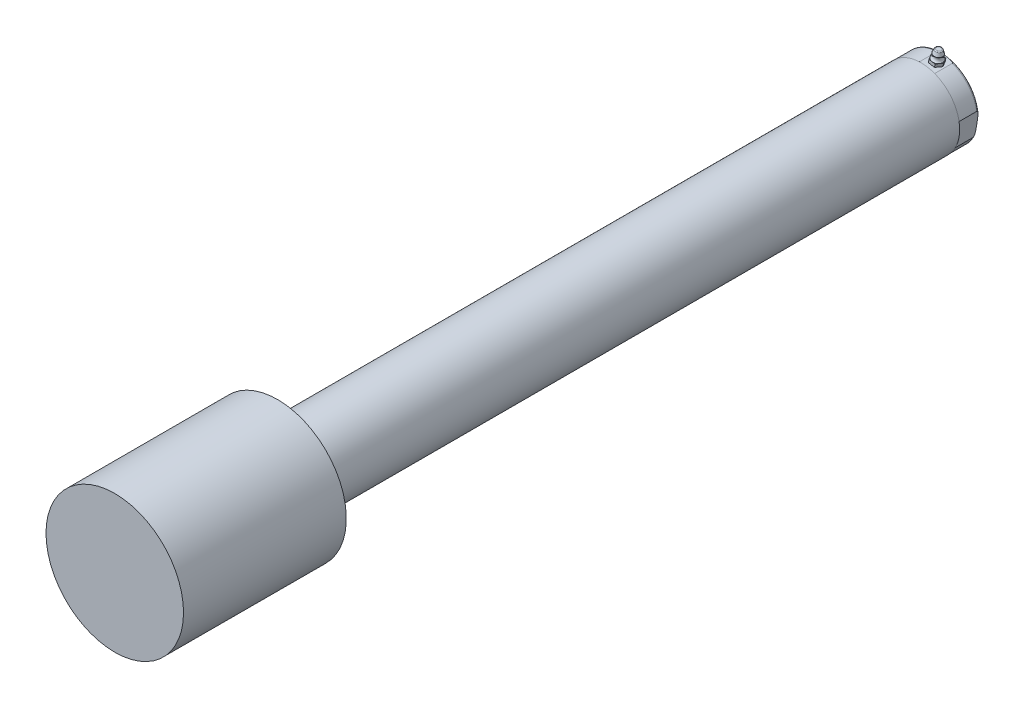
ISO-10303-21;
HEADER;
FILE_DESCRIPTION(('STEP AP214'),'2;1');
FILE_NAME('part.step','',(''),(''),'','','');
FILE_SCHEMA(('AUTOMOTIVE_DESIGN { 1 0 10303 214 1 1 1 1 }'));
ENDSEC;
DATA;
#1=APPLICATION_CONTEXT('core data for automotive mechanical design processes');
#2=APPLICATION_PROTOCOL_DEFINITION('international standard','automotive_design',2000,#1);
#3=PRODUCT_CONTEXT('',#1,'mechanical');
#4=PRODUCT('Part','Part','',(#3));
#5=PRODUCT_RELATED_PRODUCT_CATEGORY('part','',(#4));
#6=PRODUCT_DEFINITION_FORMATION('','',#4);
#7=PRODUCT_DEFINITION_CONTEXT('part definition',#1,'design');
#8=PRODUCT_DEFINITION('design','',#6,#7);
#9=PRODUCT_DEFINITION_SHAPE('','',#8);
#10=(LENGTH_UNIT() NAMED_UNIT(*) SI_UNIT(.MILLI.,.METRE.));
#11=(NAMED_UNIT(*) PLANE_ANGLE_UNIT() SI_UNIT($,.RADIAN.));
#12=(NAMED_UNIT(*) SI_UNIT($,.STERADIAN.) SOLID_ANGLE_UNIT());
#13=UNCERTAINTY_MEASURE_WITH_UNIT(LENGTH_MEASURE(1.E-05),#10,'distance_accuracy_value','');
#14=(GEOMETRIC_REPRESENTATION_CONTEXT(3) GLOBAL_UNCERTAINTY_ASSIGNED_CONTEXT((#13)) GLOBAL_UNIT_ASSIGNED_CONTEXT((#10,
#11,#12)) REPRESENTATION_CONTEXT('',''));
#15=CARTESIAN_POINT('',(0.,0.,0.));
#16=DIRECTION('',(0.,0.,1.));
#17=DIRECTION('',(1.,0.,0.));
#18=AXIS2_PLACEMENT_3D('',#15,#16,#17);
#19=CARTESIAN_POINT('',(0.,0.,-442.2648));
#20=DIRECTION('',(0.,0.,-1.));
#21=DIRECTION('',(-1.,0.,0.));
#22=AXIS2_PLACEMENT_3D('',#19,#20,#21);
#23=PLANE('',#22);
#24=CARTESIAN_POINT('',(0.,0.,-442.2648));
#25=DIRECTION('',(0.,0.,-1.));
#26=DIRECTION('',(-0.156434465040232,-0.987688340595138,0.));
#27=AXIS2_PLACEMENT_3D('',#24,#25,#26);
#28=CIRCLE('',#27,14.8844);
#29=CARTESIAN_POINT('',(-2.32843315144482,-14.7011483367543,-442.2648));
#30=VERTEX_POINT('',#29);
#31=EDGE_CURVE('E199',#30,#30,#28,.F.);
#32=ORIENTED_EDGE('',*,*,#31,.F.);
#33=EDGE_LOOP('',(#32));
#34=FACE_BOUND('',#33,.T.);
#35=ADVANCED_FACE('F17',(#34),#23,.T.);
#36=CARTESIAN_POINT('',(0.,0.,-491.0328));
#37=DIRECTION('',(0.,0.,-1.));
#38=DIRECTION('',(-1.,0.,0.));
#39=AXIS2_PLACEMENT_3D('',#36,#37,#38);
#40=PLANE('',#39);
#41=CARTESIAN_POINT('',(0.,0.,-491.0328));
#42=DIRECTION('',(0.,0.,-1.));
#43=DIRECTION('',(-1.,0.,0.));
#44=AXIS2_PLACEMENT_3D('',#41,#42,#43);
#45=CIRCLE('',#44,28.56738);
#46=CARTESIAN_POINT('',(-28.56738,0.,-491.0328));
#47=VERTEX_POINT('',#46);
#48=EDGE_CURVE('E385',#47,#47,#45,.T.);
#49=ORIENTED_EDGE('',*,*,#48,.T.);
#50=EDGE_LOOP('',(#49));
#51=FACE_BOUND('',#50,.T.);
#52=DIRECTION('',(0.987688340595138,-0.156434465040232,0.));
#53=VECTOR('',#52,1.);
#54=CARTESIAN_POINT('',(10.0230226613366,26.6373884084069,-491.0328));
#55=LINE('',#54,#53);
#56=CARTESIAN_POINT('',(-1.30105531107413,28.4309461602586,-491.0328));
#57=VERTEX_POINT('',#56);
#58=CARTESIAN_POINT('',(10.0230226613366,26.6373884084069,-491.0328));
#59=VERTEX_POINT('',#58);
#60=EDGE_CURVE('E10',#57,#59,#55,.T.);
#61=ORIENTED_EDGE('',*,*,#60,.F.);
#62=CARTESIAN_POINT('',(0.,0.,-491.0328));
#63=DIRECTION('',(0.,0.,-1.));
#64=DIRECTION('',(-1.,0.,0.));
#65=AXIS2_PLACEMENT_3D('',#62,#63,#64);
#66=CIRCLE('',#65,28.4607);
#67=CARTESIAN_POINT('',(-25.1493362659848,13.3237505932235,-491.0328));
#68=VERTEX_POINT('',#67);
#69=EDGE_CURVE('E390',#57,#68,#66,.F.);
#70=ORIENTED_EDGE('',*,*,#69,.T.);
#71=DIRECTION('',(-0.156434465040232,-0.987688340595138,0.));
#72=VECTOR('',#71,1.);
#73=CARTESIAN_POINT('',(-26.5925208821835,4.21184153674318,-491.0328));
#74=LINE('',#73,#72);
#75=CARTESIAN_POINT('',(-28.0357054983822,-4.9000675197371,-491.0328));
#76=VERTEX_POINT('',#75);
#77=EDGE_CURVE('E314',#68,#76,#74,.T.);
#78=ORIENTED_EDGE('',*,*,#77,.T.);
#79=CARTESIAN_POINT('',(0.,0.,-491.0328));
#80=DIRECTION('',(0.,0.,-1.));
#81=DIRECTION('',(-1.,0.,0.));
#82=AXIS2_PLACEMENT_3D('',#79,#80,#81);
#83=CIRCLE('',#82,28.4607);
#84=CARTESIAN_POINT('',(25.1493362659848,-13.3237505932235,-491.0328));
#85=VERTEX_POINT('',#84);
#86=EDGE_CURVE('E304',#76,#85,#83,.F.);
#87=ORIENTED_EDGE('',*,*,#86,.T.);
#88=DIRECTION('',(0.156434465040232,0.987688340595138,0.));
#89=VECTOR('',#88,1.);
#90=CARTESIAN_POINT('',(26.5925208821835,-4.21184153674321,-491.0328));
#91=LINE('',#90,#89);
#92=CARTESIAN_POINT('',(28.0357054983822,4.9000675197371,-491.0328));
#93=VERTEX_POINT('',#92);
#94=EDGE_CURVE('E315',#85,#93,#91,.T.);
#95=ORIENTED_EDGE('',*,*,#94,.T.);
#96=CARTESIAN_POINT('',(0.,0.,-491.0328));
#97=DIRECTION('',(0.,0.,-1.));
#98=DIRECTION('',(-1.,0.,0.));
#99=AXIS2_PLACEMENT_3D('',#96,#97,#98);
#100=CIRCLE('',#99,28.4607);
#101=EDGE_CURVE('E27',#93,#59,#100,.F.);
#102=ORIENTED_EDGE('',*,*,#101,.T.);
#103=EDGE_LOOP('',(#61,#70,#78,#87,#95,#102));
#104=FACE_BOUND('',#103,.T.);
#105=ADVANCED_FACE('F231',(#51,#104),#40,.T.);
#106=CARTESIAN_POINT('',(0.,0.,-465.6328));
#107=DIRECTION('',(0.,0.,-1.));
#108=DIRECTION('',(-1.,0.,0.));
#109=AXIS2_PLACEMENT_3D('',#106,#107,#108);
#110=CYLINDRICAL_SURFACE('',#109,28.56738);
#111=ORIENTED_EDGE('',*,*,#48,.F.);
#112=EDGE_LOOP('',(#111));
#113=FACE_BOUND('',#112,.T.);
#114=CARTESIAN_POINT('',(0.,0.,-15.6718));
#115=DIRECTION('',(0.,0.,-1.));
#116=DIRECTION('',(-1.,0.,0.));
#117=AXIS2_PLACEMENT_3D('',#114,#115,#116);
#118=CIRCLE('',#117,28.56738);
#119=CARTESIAN_POINT('',(-28.56738,0.,-15.6718));
#120=VERTEX_POINT('',#119);
#121=EDGE_CURVE('E373',#120,#120,#118,.T.);
#122=ORIENTED_EDGE('',*,*,#121,.T.);
#123=EDGE_LOOP('',(#122));
#124=FACE_BOUND('',#123,.T.);
#125=ADVANCED_FACE('F227',(#113,#124),#110,.T.);
#126=CARTESIAN_POINT('',(0.,0.,-15.6718));
#127=DIRECTION('',(0.,0.,-1.));
#128=DIRECTION('',(-1.,0.,0.));
#129=AXIS2_PLACEMENT_3D('',#126,#127,#128);
#130=PLANE('',#129);
#131=ORIENTED_EDGE('',*,*,#121,.F.);
#132=EDGE_LOOP('',(#131));
#133=FACE_BOUND('',#132,.T.);
#134=CARTESIAN_POINT('',(0.,0.,-15.6718));
#135=DIRECTION('',(0.,0.,-1.));
#136=DIRECTION('',(-1.,0.,0.));
#137=AXIS2_PLACEMENT_3D('',#134,#135,#136);
#138=CIRCLE('',#137,50.8);
#139=CARTESIAN_POINT('',(-50.8,0.,-15.6718));
#140=VERTEX_POINT('',#139);
#141=EDGE_CURVE('E376',#140,#140,#138,.T.);
#142=ORIENTED_EDGE('',*,*,#141,.T.);
#143=EDGE_LOOP('',(#142));
#144=FACE_BOUND('',#143,.T.);
#145=ADVANCED_FACE('F230',(#133,#144),#130,.T.);
#146=CARTESIAN_POINT('',(0.,0.,104.5718));
#147=DIRECTION('',(0.,0.,1.));
#148=DIRECTION('',(1.,0.,0.));
#149=AXIS2_PLACEMENT_3D('',#146,#147,#148);
#150=PLANE('',#149);
#151=CARTESIAN_POINT('',(0.,0.,104.5718));
#152=DIRECTION('',(0.,0.,1.));
#153=DIRECTION('',(1.,0.,0.));
#154=AXIS2_PLACEMENT_3D('',#151,#152,#153);
#155=CIRCLE('',#154,50.8);
#156=CARTESIAN_POINT('',(50.8,0.,104.5718));
#157=VERTEX_POINT('',#156);
#158=EDGE_CURVE('E380',#157,#157,#155,.T.);
#159=ORIENTED_EDGE('',*,*,#158,.T.);
#160=EDGE_LOOP('',(#159));
#161=FACE_BOUND('',#160,.T.);
#162=ADVANCED_FACE('F240',(#161),#150,.T.);
#163=CARTESIAN_POINT('',(0.,0.,104.5718));
#164=DIRECTION('',(0.,0.,-1.));
#165=DIRECTION('',(-1.,0.,0.));
#166=AXIS2_PLACEMENT_3D('',#163,#164,#165);
#167=CYLINDRICAL_SURFACE('',#166,50.8);
#168=ORIENTED_EDGE('',*,*,#158,.F.);
#169=EDGE_LOOP('',(#168));
#170=FACE_BOUND('',#169,.T.);
#171=ORIENTED_EDGE('',*,*,#141,.F.);
#172=EDGE_LOOP('',(#171));
#173=FACE_BOUND('',#172,.T.);
#174=ADVANCED_FACE('F236',(#170,#173),#167,.T.);
#175=CARTESIAN_POINT('',(5.78893702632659,36.5499099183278,-498.3988));
#176=DIRECTION('',(0.156434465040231,0.987688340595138,0.));
#177=DIRECTION('',(-0.855363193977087,0.135476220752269,0.5));
#178=AXIS2_PLACEMENT_3D('',#175,#176,#177);
#179=PLANE('',#178);
#180=CARTESIAN_POINT('',(5.78893702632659,36.5499099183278,-498.3988));
#181=DIRECTION('',(0.156434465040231,0.987688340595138,0.));
#182=DIRECTION('',(-0.855363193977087,0.135476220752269,0.5));
#183=AXIS2_PLACEMENT_3D('',#180,#181,#182);
#184=CIRCLE('',#183,1.7474960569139);
#185=CARTESIAN_POINT('',(4.29419321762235,36.786654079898,-497.525051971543));
#186=VERTEX_POINT('',#185);
#187=EDGE_CURVE('E21',#186,#186,#184,.T.);
#188=ORIENTED_EDGE('',*,*,#187,.T.);
#189=EDGE_LOOP('',(#188));
#190=FACE_BOUND('',#189,.T.);
#191=ADVANCED_FACE('F239',(#190),#179,.T.);
#192=CARTESIAN_POINT('',(5.66973396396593,35.7972914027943,-498.3988));
#193=DIRECTION('',(0.156434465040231,0.987688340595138,0.));
#194=DIRECTION('',(-0.855363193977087,0.135476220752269,0.5));
#195=AXIS2_PLACEMENT_3D('',#192,#193,#194);
#196=TOROIDAL_SURFACE('',#195,1.7474960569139,0.762);
#197=ORIENTED_EDGE('',*,*,#187,.F.);
#198=EDGE_LOOP('',(#197));
#199=FACE_BOUND('',#198,.T.);
#200=CARTESIAN_POINT('',(5.70952956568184,36.0485509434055,-498.3988));
#201=DIRECTION('',(0.156434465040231,0.987688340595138,0.));
#202=DIRECTION('',(-0.855363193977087,0.135476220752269,0.5));
#203=AXIS2_PLACEMENT_3D('',#200,#201,#202);
#204=CIRCLE('',#203,2.46577800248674);
#205=CARTESIAN_POINT('',(3.60039381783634,36.3826052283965,-497.165910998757));
#206=VERTEX_POINT('',#205);
#207=EDGE_CURVE('E182',#206,#206,#204,.F.);
#208=ORIENTED_EDGE('',*,*,#207,.F.);
#209=EDGE_LOOP('',(#208));
#210=FACE_BOUND('',#209,.T.);
#211=ADVANCED_FACE('F19',(#199,#210),#196,.T.);
#212=CARTESIAN_POINT('',(5.31212477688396,33.5394358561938,-498.3988));
#213=DIRECTION('',(-0.156434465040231,-0.987688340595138,0.));
#214=DIRECTION('',(0.855363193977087,-0.135476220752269,-0.5));
#215=AXIS2_PLACEMENT_3D('',#212,#213,#214);
#216=CONICAL_SURFACE('',#215,3.3655,0.340381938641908);
#217=ORIENTED_EDGE('',*,*,#207,.T.);
#218=EDGE_LOOP('',(#217));
#219=FACE_BOUND('',#218,.T.);
#220=CARTESIAN_POINT('',(5.31212477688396,33.5394358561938,-498.3988));
#221=DIRECTION('',(-0.156434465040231,-0.987688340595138,0.));
#222=DIRECTION('',(0.855363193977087,-0.135476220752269,-0.5));
#223=AXIS2_PLACEMENT_3D('',#220,#221,#222);
#224=CIRCLE('',#223,3.3655);
#225=CARTESIAN_POINT('',(8.19084960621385,33.083490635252,-500.08155));
#226=VERTEX_POINT('',#225);
#227=EDGE_CURVE('E152',#226,#226,#224,.T.);
#228=ORIENTED_EDGE('',*,*,#227,.F.);
#229=EDGE_LOOP('',(#228));
#230=FACE_BOUND('',#229,.T.);
#231=ADVANCED_FACE('F430',(#219,#230),#216,.T.);
#232=CARTESIAN_POINT('',(5.06209404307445,31.9608039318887,-498.3988));
#233=DIRECTION('',(-0.156434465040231,-0.987688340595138,0.));
#234=DIRECTION('',(0.855363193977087,-0.135476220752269,-0.5));
#235=AXIS2_PLACEMENT_3D('',#232,#233,#234);
#236=TOROIDAL_SURFACE('',#235,5.20693450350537,2.43833450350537);
#237=ORIENTED_EDGE('',*,*,#227,.T.);
#238=EDGE_LOOP('',(#237));
#239=FACE_BOUND('',#238,.T.);
#240=CARTESIAN_POINT('',(4.73349324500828,29.886100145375,-498.3988));
#241=DIRECTION('',(-0.156434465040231,-0.987688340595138,0.));
#242=DIRECTION('',(0.855363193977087,-0.135476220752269,-0.5));
#243=AXIS2_PLACEMENT_3D('',#240,#241,#242);
#244=CIRCLE('',#243,3.96875);
#245=CARTESIAN_POINT('',(8.12821592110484,29.3484288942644,-500.383175));
#246=VERTEX_POINT('',#245);
#247=CARTESIAN_POINT('',(8.12821592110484,29.3484288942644,-496.414425));
#248=VERTEX_POINT('',#247);
#249=EDGE_CURVE('E120',#246,#248,#244,.T.);
#250=ORIENTED_EDGE('',*,*,#249,.F.);
#251=CARTESIAN_POINT('',(4.73349324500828,29.886100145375,-502.36755));
#252=VERTEX_POINT('',#251);
#253=EDGE_CURVE('E131',#252,#246,#244,.T.);
#254=ORIENTED_EDGE('',*,*,#253,.F.);
#255=CARTESIAN_POINT('',(1.33877056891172,30.4237713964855,-500.383175));
#256=VERTEX_POINT('',#255);
#257=EDGE_CURVE('E478',#256,#252,#244,.T.);
#258=ORIENTED_EDGE('',*,*,#257,.F.);
#259=CARTESIAN_POINT('',(1.33877056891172,30.4237713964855,-496.414425));
#260=VERTEX_POINT('',#259);
#261=EDGE_CURVE('E149',#260,#256,#244,.T.);
#262=ORIENTED_EDGE('',*,*,#261,.F.);
#263=CARTESIAN_POINT('',(4.73349324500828,29.886100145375,-494.43005));
#264=VERTEX_POINT('',#263);
#265=EDGE_CURVE('E148',#264,#260,#244,.T.);
#266=ORIENTED_EDGE('',*,*,#265,.F.);
#267=EDGE_CURVE('E114',#248,#264,#244,.T.);
#268=ORIENTED_EDGE('',*,*,#267,.F.);
#269=EDGE_LOOP('',(#250,#254,#258,#262,#266,#268));
#270=FACE_BOUND('',#269,.T.);
#271=ADVANCED_FACE('F146',(#239,#270),#236,.F.);
#272=CARTESIAN_POINT('',(6.99664169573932,29.5276526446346,-502.36755));
#273=DIRECTION('',(0.156434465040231,0.987688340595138,0.));
#274=DIRECTION('',(0.493844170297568,-0.0782172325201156,0.866025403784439));
#275=AXIS2_PLACEMENT_3D('',#272,#273,#274);
#276=PLANE('',#275);
#277=ORIENTED_EDGE('',*,*,#257,.T.);
#278=DIRECTION('',(-0.987688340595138,0.156434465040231,0.));
#279=VECTOR('',#278,1.);
#280=CARTESIAN_POINT('',(6.99664169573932,29.5276526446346,-502.36755));
#281=LINE('',#280,#279);
#282=CARTESIAN_POINT('',(2.47034479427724,30.2445476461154,-502.36755));
#283=VERTEX_POINT('',#282);
#284=EDGE_CURVE('E155',#252,#283,#281,.T.);
#285=ORIENTED_EDGE('',*,*,#284,.T.);
#286=DIRECTION('',(-0.493844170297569,0.0782172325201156,0.866025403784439));
#287=VECTOR('',#286,1.);
#288=CARTESIAN_POINT('',(2.47034479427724,30.2445476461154,-502.36755));
#289=LINE('',#288,#287);
#290=EDGE_CURVE('E160',#283,#256,#289,.T.);
#291=ORIENTED_EDGE('',*,*,#290,.T.);
#292=EDGE_LOOP('',(#277,#285,#291));
#293=FACE_BOUND('',#292,.T.);
#294=ADVANCED_FACE('F417',(#293),#276,.T.);
#295=ORIENTED_EDGE('',*,*,#261,.T.);
#296=CARTESIAN_POINT('',(0.207196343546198,30.6029951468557,-498.3988));
#297=VERTEX_POINT('',#296);
#298=EDGE_CURVE('E159',#256,#297,#289,.T.);
#299=ORIENTED_EDGE('',*,*,#298,.T.);
#300=DIRECTION('',(0.493844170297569,-0.0782172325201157,0.866025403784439));
#301=VECTOR('',#300,1.);
#302=CARTESIAN_POINT('',(0.207196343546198,30.6029951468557,-498.3988));
#303=LINE('',#302,#301);
#304=EDGE_CURVE('E163',#297,#260,#303,.T.);
#305=ORIENTED_EDGE('',*,*,#304,.T.);
#306=EDGE_LOOP('',(#295,#299,#305));
#307=FACE_BOUND('',#306,.T.);
#308=ADVANCED_FACE('F248',(#307),#276,.T.);
#309=ORIENTED_EDGE('',*,*,#265,.T.);
#310=CARTESIAN_POINT('',(2.47034479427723,30.2445476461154,-494.43005));
#311=VERTEX_POINT('',#310);
#312=EDGE_CURVE('E162',#260,#311,#303,.T.);
#313=ORIENTED_EDGE('',*,*,#312,.T.);
#314=DIRECTION('',(0.987688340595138,-0.156434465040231,0.));
#315=VECTOR('',#314,1.);
#316=CARTESIAN_POINT('',(2.47034479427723,30.2445476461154,-494.43005));
#317=LINE('',#316,#315);
#318=EDGE_CURVE('E140',#311,#264,#317,.T.);
#319=ORIENTED_EDGE('',*,*,#318,.T.);
#320=EDGE_LOOP('',(#309,#313,#319));
#321=FACE_BOUND('',#320,.T.);
#322=ADVANCED_FACE('F488',(#321),#276,.T.);
#323=ORIENTED_EDGE('',*,*,#267,.T.);
#324=CARTESIAN_POINT('',(6.99664169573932,29.5276526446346,-494.43005));
#325=VERTEX_POINT('',#324);
#326=EDGE_CURVE('E143',#264,#325,#317,.T.);
#327=ORIENTED_EDGE('',*,*,#326,.T.);
#328=DIRECTION('',(0.493844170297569,-0.0782172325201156,-0.866025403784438));
#329=VECTOR('',#328,1.);
#330=CARTESIAN_POINT('',(6.99664169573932,29.5276526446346,-494.43005));
#331=LINE('',#330,#329);
#332=EDGE_CURVE('E137',#325,#248,#331,.T.);
#333=ORIENTED_EDGE('',*,*,#332,.T.);
#334=EDGE_LOOP('',(#323,#327,#333));
#335=FACE_BOUND('',#334,.T.);
#336=ADVANCED_FACE('F142',(#335),#276,.T.);
#337=ORIENTED_EDGE('',*,*,#249,.T.);
#338=CARTESIAN_POINT('',(9.25979014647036,29.1692051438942,-498.3988));
#339=VERTEX_POINT('',#338);
#340=EDGE_CURVE('E123',#248,#339,#331,.T.);
#341=ORIENTED_EDGE('',*,*,#340,.T.);
#342=DIRECTION('',(-0.493844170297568,0.0782172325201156,-0.866025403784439));
#343=VECTOR('',#342,1.);
#344=CARTESIAN_POINT('',(9.25979014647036,29.1692051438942,-498.3988));
#345=LINE('',#344,#343);
#346=EDGE_CURVE('E126',#339,#246,#345,.T.);
#347=ORIENTED_EDGE('',*,*,#346,.T.);
#348=EDGE_LOOP('',(#337,#341,#347));
#349=FACE_BOUND('',#348,.T.);
#350=ADVANCED_FACE('F122',(#349),#276,.T.);
#351=ORIENTED_EDGE('',*,*,#253,.T.);
#352=CARTESIAN_POINT('',(6.99664169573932,29.5276526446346,-502.36755));
#353=VERTEX_POINT('',#352);
#354=EDGE_CURVE('E129',#246,#353,#345,.T.);
#355=ORIENTED_EDGE('',*,*,#354,.T.);
#356=EDGE_CURVE('E156',#353,#252,#281,.T.);
#357=ORIENTED_EDGE('',*,*,#356,.T.);
#358=EDGE_LOOP('',(#351,#355,#357));
#359=FACE_BOUND('',#358,.T.);
#360=ADVANCED_FACE('F273',(#359),#276,.T.);
#361=CARTESIAN_POINT('',(2.32843315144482,14.7011483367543,-505.7648));
#362=DIRECTION('',(0.,0.,1.));
#363=DIRECTION('',(0.156434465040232,0.987688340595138,0.));
#364=AXIS2_PLACEMENT_3D('',#361,#362,#363);
#365=PLANE('',#364);
#366=CARTESIAN_POINT('',(0.,0.,-505.7648));
#367=DIRECTION('',(0.,0.,1.));
#368=DIRECTION('',(0.156434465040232,0.987688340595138,0.));
#369=AXIS2_PLACEMENT_3D('',#366,#367,#368);
#370=CIRCLE('',#369,16.1544);
#371=CARTESIAN_POINT('',(2.52710492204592,15.9555125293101,-505.7648));
#372=VERTEX_POINT('',#371);
#373=EDGE_CURVE('E353',#372,#372,#370,.T.);
#374=ORIENTED_EDGE('',*,*,#373,.T.);
#375=EDGE_LOOP('',(#374));
#376=FACE_BOUND('',#375,.T.);
#377=CARTESIAN_POINT('',(0.,0.,-505.7648));
#378=DIRECTION('',(0.,0.,1.));
#379=DIRECTION('',(0.156434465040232,0.987688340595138,0.));
#380=AXIS2_PLACEMENT_3D('',#377,#378,#379);
#381=CIRCLE('',#380,26.8732);
#382=CARTESIAN_POINT('',(4.20389466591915,26.5423463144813,-505.7648));
#383=VERTEX_POINT('',#382);
#384=EDGE_CURVE('E343',#383,#383,#381,.F.);
#385=ORIENTED_EDGE('',*,*,#384,.T.);
#386=EDGE_LOOP('',(#385));
#387=FACE_BOUND('',#386,.T.);
#388=ADVANCED_FACE('F298',(#376,#387),#365,.F.);
#389=CARTESIAN_POINT('',(0.,0.,-504.4948));
#390=DIRECTION('',(0.,0.,-1.));
#391=DIRECTION('',(-0.156434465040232,-0.987688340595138,0.));
#392=AXIS2_PLACEMENT_3D('',#389,#390,#391);
#393=CONICAL_SURFACE('',#392,14.8844,0.785398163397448);
#394=ORIENTED_EDGE('',*,*,#373,.F.);
#395=EDGE_LOOP('',(#394));
#396=FACE_BOUND('',#395,.T.);
#397=CARTESIAN_POINT('',(0.,0.,-504.4948));
#398=DIRECTION('',(0.,0.,1.));
#399=DIRECTION('',(0.156434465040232,0.987688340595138,0.));
#400=AXIS2_PLACEMENT_3D('',#397,#398,#399);
#401=CIRCLE('',#400,14.8844);
#402=CARTESIAN_POINT('',(2.32843315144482,14.7011483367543,-504.4948));
#403=VERTEX_POINT('',#402);
#404=EDGE_CURVE('E349',#403,#403,#401,.F.);
#405=ORIENTED_EDGE('',*,*,#404,.F.);
#406=EDGE_LOOP('',(#405));
#407=FACE_BOUND('',#406,.T.);
#408=ADVANCED_FACE('F405',(#396,#407),#393,.F.);
#409=CARTESIAN_POINT('',(0.,0.,-508.457012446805));
#410=DIRECTION('',(0.,0.,-1.));
#411=DIRECTION('',(-0.156434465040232,-0.987688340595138,0.));
#412=AXIS2_PLACEMENT_3D('',#409,#410,#411);
#413=CYLINDRICAL_SURFACE('',#412,14.8844);
#414=ORIENTED_EDGE('',*,*,#31,.T.);
#415=EDGE_LOOP('',(#414));
#416=FACE_BOUND('',#415,.T.);
#417=ORIENTED_EDGE('',*,*,#404,.T.);
#418=EDGE_LOOP('',(#417));
#419=FACE_BOUND('',#418,.T.);
#420=ADVANCED_FACE('F412',(#416,#419),#413,.F.);
#421=CARTESIAN_POINT('',(6.99664169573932,29.5276526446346,-502.36755));
#422=DIRECTION('',(0.,0.,1.));
#423=DIRECTION('',(0.987688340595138,-0.156434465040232,0.));
#424=AXIS2_PLACEMENT_3D('',#421,#422,#423);
#425=PLANE('',#424);
#426=DIRECTION('',(-0.987688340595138,0.156434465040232,0.));
#427=VECTOR('',#426,1.);
#428=CARTESIAN_POINT('',(10.0230226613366,26.6373884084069,-502.36755));
#429=LINE('',#428,#427);
#430=CARTESIAN_POINT('',(6.62413212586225,27.1757197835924,-502.36755));
#431=VERTEX_POINT('',#430);
#432=CARTESIAN_POINT('',(2.0978352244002,27.8926147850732,-502.36755));
#433=VERTEX_POINT('',#432);
#434=EDGE_CURVE('E366',#431,#433,#429,.T.);
#435=ORIENTED_EDGE('',*,*,#434,.T.);
#436=DIRECTION('',(-0.156434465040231,-0.987688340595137,0.));
#437=VECTOR('',#436,1.);
#438=CARTESIAN_POINT('',(2.47034479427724,30.2445476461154,-502.36755));
#439=LINE('',#438,#437);
#440=EDGE_CURVE('E177',#283,#433,#439,.T.);
#441=ORIENTED_EDGE('',*,*,#440,.F.);
#442=ORIENTED_EDGE('',*,*,#284,.F.);
#443=ORIENTED_EDGE('',*,*,#356,.F.);
#444=DIRECTION('',(-0.156434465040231,-0.987688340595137,0.));
#445=VECTOR('',#444,1.);
#446=CARTESIAN_POINT('',(6.99664169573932,29.5276526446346,-502.36755));
#447=LINE('',#446,#445);
#448=EDGE_CURVE('E180',#353,#431,#447,.T.);
#449=ORIENTED_EDGE('',*,*,#448,.T.);
#450=EDGE_LOOP('',(#435,#441,#442,#443,#449));
#451=FACE_BOUND('',#450,.T.);
#452=ADVANCED_FACE('F274',(#451),#425,.F.);
#453=CARTESIAN_POINT('',(2.47034479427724,30.2445476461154,-502.36755));
#454=DIRECTION('',(0.855363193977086,-0.135476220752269,0.5));
#455=DIRECTION('',(0.493844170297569,-0.0782172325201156,-0.866025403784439));
#456=AXIS2_PLACEMENT_3D('',#453,#454,#455);
#457=PLANE('',#456);
#458=DIRECTION('',(-0.493844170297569,0.0782172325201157,0.866025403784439));
#459=VECTOR('',#458,1.);
#460=CARTESIAN_POINT('',(-38.8016618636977,34.3704587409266,-430.644513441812));
#461=LINE('',#460,#459);
#462=CARTESIAN_POINT('',(-0.165313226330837,28.2510622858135,-498.3988));
#463=VERTEX_POINT('',#462);
#464=EDGE_CURVE('E363',#433,#463,#461,.T.);
#465=ORIENTED_EDGE('',*,*,#464,.T.);
#466=DIRECTION('',(-0.156434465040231,-0.987688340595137,0.));
#467=VECTOR('',#466,1.);
#468=CARTESIAN_POINT('',(0.207196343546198,30.6029951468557,-498.3988));
#469=LINE('',#468,#467);
#470=EDGE_CURVE('E174',#297,#463,#469,.T.);
#471=ORIENTED_EDGE('',*,*,#470,.F.);
#472=ORIENTED_EDGE('',*,*,#298,.F.);
#473=ORIENTED_EDGE('',*,*,#290,.F.);
#474=ORIENTED_EDGE('',*,*,#440,.T.);
#475=EDGE_LOOP('',(#465,#471,#472,#473,#474));
#476=FACE_BOUND('',#475,.T.);
#477=ADVANCED_FACE('F424',(#476),#457,.F.);
#478=CARTESIAN_POINT('',(0.207196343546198,30.6029951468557,-498.3988));
#479=DIRECTION('',(0.855363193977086,-0.135476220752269,-0.5));
#480=DIRECTION('',(-0.493844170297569,0.0782172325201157,-0.866025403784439));
#481=AXIS2_PLACEMENT_3D('',#478,#479,#480);
#482=PLANE('',#481);
#483=DIRECTION('',(0.493844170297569,-0.0782172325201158,0.866025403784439));
#484=VECTOR('',#483,1.);
#485=CARTESIAN_POINT('',(43.5652033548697,21.3248288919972,-421.711171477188));
#486=LINE('',#485,#484);
#487=CARTESIAN_POINT('',(2.09783522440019,27.8926147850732,-494.43005));
#488=VERTEX_POINT('',#487);
#489=EDGE_CURVE('E360',#463,#488,#486,.T.);
#490=ORIENTED_EDGE('',*,*,#489,.T.);
#491=DIRECTION('',(-0.156434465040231,-0.987688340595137,0.));
#492=VECTOR('',#491,1.);
#493=CARTESIAN_POINT('',(2.47034479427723,30.2445476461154,-494.43005));
#494=LINE('',#493,#492);
#495=EDGE_CURVE('E171',#311,#488,#494,.T.);
#496=ORIENTED_EDGE('',*,*,#495,.F.);
#497=ORIENTED_EDGE('',*,*,#312,.F.);
#498=ORIENTED_EDGE('',*,*,#304,.F.);
#499=ORIENTED_EDGE('',*,*,#470,.T.);
#500=EDGE_LOOP('',(#490,#496,#497,#498,#499));
#501=FACE_BOUND('',#500,.T.);
#502=ADVANCED_FACE('F458',(#501),#482,.F.);
#503=CARTESIAN_POINT('',(2.47034479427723,30.2445476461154,-494.43005));
#504=DIRECTION('',(0.,0.,-1.));
#505=DIRECTION('',(-0.987688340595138,0.156434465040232,0.));
#506=AXIS2_PLACEMENT_3D('',#503,#504,#505);
#507=PLANE('',#506);
#508=DIRECTION('',(0.987688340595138,-0.156434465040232,0.));
#509=VECTOR('',#508,1.);
#510=CARTESIAN_POINT('',(10.0230226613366,26.6373884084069,-494.43005));
#511=LINE('',#510,#509);
#512=CARTESIAN_POINT('',(6.62413212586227,27.1757197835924,-494.43005));
#513=VERTEX_POINT('',#512);
#514=EDGE_CURVE('E358',#488,#513,#511,.T.);
#515=ORIENTED_EDGE('',*,*,#514,.T.);
#516=DIRECTION('',(-0.156434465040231,-0.987688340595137,0.));
#517=VECTOR('',#516,1.);
#518=CARTESIAN_POINT('',(6.99664169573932,29.5276526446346,-494.43005));
#519=LINE('',#518,#517);
#520=EDGE_CURVE('E169',#325,#513,#519,.T.);
#521=ORIENTED_EDGE('',*,*,#520,.F.);
#522=ORIENTED_EDGE('',*,*,#326,.F.);
#523=ORIENTED_EDGE('',*,*,#318,.F.);
#524=ORIENTED_EDGE('',*,*,#495,.T.);
#525=EDGE_LOOP('',(#515,#521,#522,#523,#524));
#526=FACE_BOUND('',#525,.T.);
#527=ADVANCED_FACE('F455',(#526),#507,.F.);
#528=CARTESIAN_POINT('',(6.99664169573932,29.5276526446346,-494.43005));
#529=DIRECTION('',(-0.855363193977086,0.135476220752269,-0.5));
#530=DIRECTION('',(-0.493844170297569,0.0782172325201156,0.866025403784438));
#531=AXIS2_PLACEMENT_3D('',#528,#529,#530);
#532=PLANE('',#531);
#533=DIRECTION('',(0.493844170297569,-0.0782172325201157,-0.866025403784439));
#534=VECTOR('',#533,1.);
#535=CARTESIAN_POINT('',(-32.0122165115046,33.2951162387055,-426.675763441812));
#536=LINE('',#535,#534);
#537=CARTESIAN_POINT('',(8.88728057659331,26.8172722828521,-498.3988));
#538=VERTEX_POINT('',#537);
#539=EDGE_CURVE('E356',#513,#538,#536,.T.);
#540=ORIENTED_EDGE('',*,*,#539,.T.);
#541=DIRECTION('',(-0.156434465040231,-0.987688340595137,0.));
#542=VECTOR('',#541,1.);
#543=CARTESIAN_POINT('',(9.25979014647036,29.1692051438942,-498.3988));
#544=LINE('',#543,#542);
#545=EDGE_CURVE('E139',#339,#538,#544,.T.);
#546=ORIENTED_EDGE('',*,*,#545,.F.);
#547=ORIENTED_EDGE('',*,*,#340,.F.);
#548=ORIENTED_EDGE('',*,*,#332,.F.);
#549=ORIENTED_EDGE('',*,*,#520,.T.);
#550=EDGE_LOOP('',(#540,#546,#547,#548,#549));
#551=FACE_BOUND('',#550,.T.);
#552=ADVANCED_FACE('F135',(#551),#532,.F.);
#553=CARTESIAN_POINT('',(9.25979014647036,29.1692051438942,-498.3988));
#554=DIRECTION('',(-0.855363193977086,0.135476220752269,0.5));
#555=DIRECTION('',(-0.156434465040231,-0.987688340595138,0.));
#556=AXIS2_PLACEMENT_3D('',#553,#554,#555);
#557=PLANE('',#556);
#558=DIRECTION('',(-0.493844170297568,0.0782172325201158,-0.866025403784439));
#559=VECTOR('',#558,1.);
#560=CARTESIAN_POINT('',(50.3546487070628,20.2494863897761,-425.679921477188));
#561=LINE('',#560,#559);
#562=EDGE_CURVE('E369',#538,#431,#561,.T.);
#563=ORIENTED_EDGE('',*,*,#562,.T.);
#564=ORIENTED_EDGE('',*,*,#448,.F.);
#565=ORIENTED_EDGE('',*,*,#354,.F.);
#566=ORIENTED_EDGE('',*,*,#346,.F.);
#567=ORIENTED_EDGE('',*,*,#545,.T.);
#568=EDGE_LOOP('',(#563,#564,#565,#566,#567));
#569=FACE_BOUND('',#568,.T.);
#570=ADVANCED_FACE('F259',(#569),#557,.F.);
#571=CARTESIAN_POINT('',(10.0230226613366,26.6373884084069,-402.104189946));
#572=DIRECTION('',(-0.156434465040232,-0.987688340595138,0.));
#573=DIRECTION('',(0.,0.,1.));
#574=AXIS2_PLACEMENT_3D('',#571,#572,#573);
#575=PLANE('',#574);
#576=ORIENTED_EDGE('',*,*,#60,.T.);
#577=DIRECTION('',(0.,0.,-1.));
#578=VECTOR('',#577,1.);
#579=CARTESIAN_POINT('',(10.0230226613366,26.6373884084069,-402.104189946));
#580=LINE('',#579,#578);
#581=CARTESIAN_POINT('',(10.0230226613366,26.6373884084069,-504.1773));
#582=VERTEX_POINT('',#581);
#583=EDGE_CURVE('E191',#59,#582,#580,.T.);
#584=ORIENTED_EDGE('',*,*,#583,.T.);
#585=CARTESIAN_POINT('',(4.36098367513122,27.5341672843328,-505.406840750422));
#586=CARTESIAN_POINT('',(4.62316716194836,27.4926414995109,-505.406844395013));
#587=CARTESIAN_POINT('',(4.8853546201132,27.4511150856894,-505.403773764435));
#588=CARTESIAN_POINT('',(5.40967293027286,27.3680712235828,-505.391156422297));
#589=CARTESIAN_POINT('',(5.67180372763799,27.3265537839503,-505.381607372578));
#590=CARTESIAN_POINT('',(6.19499537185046,27.2436883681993,-505.354995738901));
#591=CARTESIAN_POINT('',(6.45605717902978,27.2023402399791,-505.337953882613));
#592=CARTESIAN_POINT('',(6.8470138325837,27.1404187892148,-505.305170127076));
#593=CARTESIAN_POINT('',(6.97720572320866,27.1197984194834,-505.293041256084));
#594=CARTESIAN_POINT('',(7.2372995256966,27.0786036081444,-505.265952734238));
#595=CARTESIAN_POINT('',(7.36720145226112,27.0580291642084,-505.250993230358));
#596=CARTESIAN_POINT('',(7.62671796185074,27.0169257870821,-505.217678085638));
#597=CARTESIAN_POINT('',(7.75633212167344,26.9963969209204,-505.199319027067));
#598=CARTESIAN_POINT('',(8.01498144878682,26.9554308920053,-505.158432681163));
#599=CARTESIAN_POINT('',(8.14401637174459,26.9349937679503,-505.135903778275));
#600=CARTESIAN_POINT('',(8.40168151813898,26.8941836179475,-505.085427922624));
#601=CARTESIAN_POINT('',(8.53030707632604,26.8738113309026,-505.057456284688));
#602=CARTESIAN_POINT('',(8.78579926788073,26.8333453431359,-504.994422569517));
#603=CARTESIAN_POINT('',(8.91266744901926,26.8132513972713,-504.959367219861));
#604=CARTESIAN_POINT('',(9.10117412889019,26.7833948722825,-504.898880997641));
#605=CARTESIAN_POINT('',(9.16400670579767,26.7734431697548,-504.877279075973));
#606=CARTESIAN_POINT('',(9.28856003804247,26.7537158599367,-504.830722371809));
#607=CARTESIAN_POINT('',(9.35027932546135,26.7439404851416,-504.80576348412));
#608=CARTESIAN_POINT('',(9.47135396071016,26.7247641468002,-504.751734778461));
#609=CARTESIAN_POINT('',(9.53072448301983,26.7153607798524,-504.722700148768));
#610=CARTESIAN_POINT('',(9.64631231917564,26.6970534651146,-504.658865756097));
#611=CARTESIAN_POINT('',(9.70253797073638,26.6881481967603,-504.624082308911));
#612=CARTESIAN_POINT('',(9.78401067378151,26.6752441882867,-504.56437972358));
#613=CARTESIAN_POINT('',(9.81140820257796,26.670904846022,-504.542496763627));
#614=CARTESIAN_POINT('',(9.86363976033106,26.66263217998,-504.49571568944));
#615=CARTESIAN_POINT('',(9.8884746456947,26.6586987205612,-504.470818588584));
#616=CARTESIAN_POINT('',(9.92798711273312,26.6524405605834,-504.424443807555));
#617=CARTESIAN_POINT('',(9.943613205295,26.6499656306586,-504.403805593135));
#618=CARTESIAN_POINT('',(9.97162366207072,26.6455292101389,-504.3603682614));
#619=CARTESIAN_POINT('',(9.98401449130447,26.6435666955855,-504.337573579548));
#620=CARTESIAN_POINT('',(10.0016591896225,26.6407720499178,-504.296073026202));
#621=CARTESIAN_POINT('',(10.0079281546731,26.6397791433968,-504.277815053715));
#622=CARTESIAN_POINT('',(10.0173876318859,26.6382809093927,-504.240500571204));
#623=CARTESIAN_POINT('',(10.020582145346,26.6377749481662,-504.221445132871));
#624=CARTESIAN_POINT('',(10.023546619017,26.637305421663,-504.182969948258));
#625=CARTESIAN_POINT('',(10.0233014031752,26.6373442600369,-504.16354896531));
#626=CARTESIAN_POINT('',(10.0193805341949,26.6379652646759,-504.125063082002));
#627=CARTESIAN_POINT('',(10.0157021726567,26.6385478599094,-504.105998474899));
#628=CARTESIAN_POINT('',(10.0043464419,26.6403464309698,-504.065264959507));
#629=CARTESIAN_POINT('',(9.99604978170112,26.641660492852,-504.043775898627));
#630=CARTESIAN_POINT('',(9.97615114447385,26.6448121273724,-504.002437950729));
#631=CARTESIAN_POINT('',(9.96454278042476,26.6466507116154,-503.982592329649));
#632=CARTESIAN_POINT('',(9.9308929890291,26.6519803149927,-503.932679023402));
#633=CARTESIAN_POINT('',(9.9068717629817,26.6557849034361,-503.90399740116));
#634=CARTESIAN_POINT('',(9.85505159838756,26.6639924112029,-503.850418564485));
#635=CARTESIAN_POINT('',(9.82724200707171,26.6683970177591,-503.825532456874));
#636=CARTESIAN_POINT('',(9.75903928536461,26.6791992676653,-503.770519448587));
#637=CARTESIAN_POINT('',(9.71767163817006,26.6857512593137,-503.741647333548));
#638=CARTESIAN_POINT('',(9.63241780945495,26.6992541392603,-503.687945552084));
#639=CARTESIAN_POINT('',(9.58852662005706,26.7062058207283,-503.663124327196));
#640=CARTESIAN_POINT('',(9.49893694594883,26.7203954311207,-503.61648901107));
#641=CARTESIAN_POINT('',(9.45323015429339,26.7276346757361,-503.594691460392));
#642=CARTESIAN_POINT('',(9.3607922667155,26.7422753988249,-503.553621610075));
#643=CARTESIAN_POINT('',(9.31406222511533,26.7496767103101,-503.534346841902));
#644=CARTESIAN_POINT('',(9.1821544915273,26.7705688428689,-503.483202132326));
#645=CARTESIAN_POINT('',(9.09612483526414,26.7841946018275,-503.453591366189));
#646=CARTESIAN_POINT('',(8.92259226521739,26.8116794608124,-503.399128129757));
#647=CARTESIAN_POINT('',(8.83508845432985,26.8255387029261,-503.374278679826));
#648=CARTESIAN_POINT('',(8.65895904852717,26.8534348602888,-503.328237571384));
#649=CARTESIAN_POINT('',(8.57033148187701,26.8674720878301,-503.307053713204));
#650=CARTESIAN_POINT('',(8.3924254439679,26.8956496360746,-503.267679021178));
#651=CARTESIAN_POINT('',(8.30314687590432,26.9097899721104,-503.249488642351));
#652=CARTESIAN_POINT('',(8.03437126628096,26.9523598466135,-503.198553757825));
#653=CARTESIAN_POINT('',(7.85419078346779,26.9808976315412,-503.169508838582));
#654=CARTESIAN_POINT('',(7.49311942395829,27.0380857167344,-503.11859362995));
#655=CARTESIAN_POINT('',(7.31222973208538,27.0667358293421,-503.096714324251));
#656=CARTESIAN_POINT('',(6.95200920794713,27.1237891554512,-503.058706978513));
#657=CARTESIAN_POINT('',(6.77268489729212,27.1521913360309,-503.042514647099));
#658=CARTESIAN_POINT('',(6.41369705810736,27.2090494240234,-503.014505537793));
#659=CARTESIAN_POINT('',(6.23403350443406,27.2375053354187,-503.002689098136));
#660=CARTESIAN_POINT('',(5.8743871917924,27.2944677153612,-502.982748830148));
#661=CARTESIAN_POINT('',(5.69440429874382,27.3229742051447,-502.97462752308));
#662=CARTESIAN_POINT('',(5.33431969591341,27.3800060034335,-502.961647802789));
#663=CARTESIAN_POINT('',(5.15421798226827,27.4085313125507,-502.956789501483));
#664=CARTESIAN_POINT('',(4.7943800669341,27.4655240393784,-502.950089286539));
#665=CARTESIAN_POINT('',(4.61464399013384,27.4939914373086,-502.948240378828));
#666=CARTESIAN_POINT('',(4.25516553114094,27.5509272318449,-502.94744223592));
#667=CARTESIAN_POINT('',(4.07542314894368,27.5793956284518,-502.948493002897));
#668=CARTESIAN_POINT('',(3.71604493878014,27.6363155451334,-502.953547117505));
#669=CARTESIAN_POINT('',(3.53640909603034,27.6647670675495,-502.957549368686));
#670=CARTESIAN_POINT('',(3.17723681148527,27.7216543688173,-502.968712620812));
#671=CARTESIAN_POINT('',(2.99770036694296,27.750090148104,-502.9758735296));
#672=CARTESIAN_POINT('',(2.63906365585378,27.8068926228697,-502.993722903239));
#673=CARTESIAN_POINT('',(2.45996313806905,27.8352593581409,-503.004406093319));
#674=CARTESIAN_POINT('',(2.1020219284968,27.891951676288,-503.029903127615));
#675=CARTESIAN_POINT('',(1.92318127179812,27.9202772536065,-503.044717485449));
#676=CARTESIAN_POINT('',(1.56586071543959,27.9768712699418,-503.079382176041));
#677=CARTESIAN_POINT('',(1.38738108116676,28.0051396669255,-503.099235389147));
#678=CARTESIAN_POINT('',(1.03126253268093,28.0615433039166,-503.145337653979));
#679=CARTESIAN_POINT('',(0.853623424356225,28.0896785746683,-503.171585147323));
#680=CARTESIAN_POINT('',(0.499365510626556,28.1457875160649,-503.232656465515));
#681=CARTESIAN_POINT('',(0.322749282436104,28.1737607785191,-503.267496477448));
#682=CARTESIAN_POINT('',(0.0601100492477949,28.2153587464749,-503.329041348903));
#683=CARTESIAN_POINT('',(-0.0269762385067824,28.2291518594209,-503.351079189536));
#684=CARTESIAN_POINT('',(-0.200079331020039,28.256568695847,-503.399074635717));
#685=CARTESIAN_POINT('',(-0.286096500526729,28.2701924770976,-503.425030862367));
#686=CARTESIAN_POINT('',(-0.437610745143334,28.2941899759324,-503.475761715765));
#687=CARTESIAN_POINT('',(-0.503435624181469,28.3046156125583,-503.499526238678));
#688=CARTESIAN_POINT('',(-0.633707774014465,28.3252486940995,-503.551120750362));
#689=CARTESIAN_POINT('',(-0.698151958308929,28.3354556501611,-503.578958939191));
#690=CARTESIAN_POINT('',(-0.82499809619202,28.3555461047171,-503.640279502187));
#691=CARTESIAN_POINT('',(-0.887380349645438,28.3654264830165,-503.673803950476));
#692=CARTESIAN_POINT('',(-1.00750004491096,28.3844515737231,-503.748719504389));
#693=CARTESIAN_POINT('',(-1.06525110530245,28.3935984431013,-503.790086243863));
#694=CARTESIAN_POINT('',(-1.14234520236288,28.4058089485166,-503.859661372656));
#695=CARTESIAN_POINT('',(-1.16577219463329,28.4095194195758,-503.883156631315));
#696=CARTESIAN_POINT('',(-1.20895768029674,28.4163593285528,-503.933386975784));
#697=CARTESIAN_POINT('',(-1.22872791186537,28.4194906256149,-503.960111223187));
#698=CARTESIAN_POINT('',(-1.25610186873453,28.423826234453,-504.006317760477));
#699=CARTESIAN_POINT('',(-1.26547822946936,28.4253113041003,-504.024712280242));
#700=CARTESIAN_POINT('',(-1.28130255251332,28.4278176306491,-504.062762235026));
#701=CARTESIAN_POINT('',(-1.2877535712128,28.4288393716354,-504.08241632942));
#702=CARTESIAN_POINT('',(-1.29710427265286,28.4303203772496,-504.122807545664));
#703=CARTESIAN_POINT('',(-1.29996767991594,28.4307738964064,-504.143553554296));
#704=CARTESIAN_POINT('',(-1.30162746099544,28.4310367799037,-504.185210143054));
#705=CARTESIAN_POINT('',(-1.30042574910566,28.4308464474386,-504.206120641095));
#706=CARTESIAN_POINT('',(-1.2945263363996,28.4299120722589,-504.244766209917));
#707=CARTESIAN_POINT('',(-1.29027766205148,28.4292391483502,-504.262575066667));
#708=CARTESIAN_POINT('',(-1.27920054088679,28.4274847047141,-504.29734311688));
#709=CARTESIAN_POINT('',(-1.27237040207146,28.4264029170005,-504.314301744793));
#710=CARTESIAN_POINT('',(-1.25204859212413,28.4231842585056,-504.356718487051));
#711=CARTESIAN_POINT('',(-1.2369908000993,28.4207993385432,-504.381402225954));
#712=CARTESIAN_POINT('',(-1.20334145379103,28.4154698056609,-504.428157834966));
#713=CARTESIAN_POINT('',(-1.18473913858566,28.4125234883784,-504.450221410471));
#714=CARTESIAN_POINT('',(-1.12752647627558,28.4034618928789,-504.510771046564));
#715=CARTESIAN_POINT('',(-1.08590139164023,28.3968691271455,-504.546296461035));
#716=CARTESIAN_POINT('',(-0.998455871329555,28.3830191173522,-504.611472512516));
#717=CARTESIAN_POINT('',(-0.95262304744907,28.3757599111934,-504.641104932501));
#718=CARTESIAN_POINT('',(-0.828754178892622,28.3561410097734,-504.713531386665));
#719=CARTESIAN_POINT('',(-0.748712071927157,28.3434635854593,-504.752770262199));
#720=CARTESIAN_POINT('',(-0.58546031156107,28.3176070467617,-504.823926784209));
#721=CARTESIAN_POINT('',(-0.502243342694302,28.3044267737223,-504.855826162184));
#722=CARTESIAN_POINT('',(-0.333581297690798,28.2777133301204,-504.914455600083));
#723=CARTESIAN_POINT('',(-0.248126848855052,28.2641786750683,-504.941157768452));
#724=CARTESIAN_POINT('',(-0.0762082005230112,28.2369494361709,-504.990454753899));
#725=CARTESIAN_POINT('',(0.0102546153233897,28.2232550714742,-505.013054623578));
#726=CARTESIAN_POINT('',(0.183838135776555,28.1957621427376,-505.055008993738));
#727=CARTESIAN_POINT('',(0.270958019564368,28.1819637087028,-505.074367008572));
#728=CARTESIAN_POINT('',(0.445731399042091,28.1542823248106,-505.110448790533));
#729=CARTESIAN_POINT('',(0.53338495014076,28.1403993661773,-505.127172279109));
#730=CARTESIAN_POINT('',(0.796992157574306,28.0986480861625,-505.174066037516));
#731=CARTESIAN_POINT('',(0.973517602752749,28.0706892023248,-505.200942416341));
#732=CARTESIAN_POINT('',(1.32774421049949,28.0145852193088,-505.248248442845));
#733=CARTESIAN_POINT('',(1.50544704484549,27.9864398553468,-505.268664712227));
#734=CARTESIAN_POINT('',(1.8613631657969,27.9300682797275,-505.304374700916));
#735=CARTESIAN_POINT('',(2.03957649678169,27.9018420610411,-505.319667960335));
#736=CARTESIAN_POINT('',(2.39629186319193,27.845343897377,-505.34606484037));
#737=CARTESIAN_POINT('',(2.57479388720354,27.8170719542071,-505.357168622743));
#738=CARTESIAN_POINT('',(2.93198716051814,27.7604980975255,-505.37580919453));
#739=CARTESIAN_POINT('',(3.11067842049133,27.7321961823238,-505.383345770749));
#740=CARTESIAN_POINT('',(3.46794874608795,27.6756101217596,-505.395245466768));
#741=CARTESIAN_POINT('',(3.64652769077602,27.6473259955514,-505.399612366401));
#742=CARTESIAN_POINT('',(4.0037317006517,27.5907504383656,-505.405408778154));
#743=CARTESIAN_POINT('',(4.18235676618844,27.5624590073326,-505.406838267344));
#744=CARTESIAN_POINT('',(4.36098367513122,27.5341672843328,-505.406840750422));
#745=B_SPLINE_CURVE_WITH_KNOTS('',3,(#585,#586,#587,#588,#589,#590,#591,#592,#593,#594,#595,
#596,#597,#598,#599,#600,#601,#602,#603,#604,#605,#606,#607,#608,#609,#610,#611,#612,#613,#614,
#615,#616,#617,#618,#619,#620,#621,#622,#623,#624,#625,#626,#627,#628,#629,#630,#631,#632,#633,
#634,#635,#636,#637,#638,#639,#640,#641,#642,#643,#644,#645,#646,#647,#648,#649,#650,#651,#652,
#653,#654,#655,#656,#657,#658,#659,#660,#661,#662,#663,#664,#665,#666,#667,#668,#669,#670,#671,
#672,#673,#674,#675,#676,#677,#678,#679,#680,#681,#682,#683,#684,#685,#686,#687,#688,#689,#690,
#691,#692,#693,#694,#695,#696,#697,#698,#699,#700,#701,#702,#703,#704,#705,#706,#707,#708,#709,
#710,#711,#712,#713,#714,#715,#716,#717,#718,#719,#720,#721,#722,#723,#724,#725,#726,#727,#728,
#729,#730,#731,#732,#733,#734,#735,#736,#737,#738,#739,#740,#741,#742,#743,#744),.UNSPECIFIED.,
.T.,.F.,(4,2,2,2,2,2,2,2,2,2,2,2,2,2,2,2,2,2,2,2,2,2,2,2,2,2,2,2,2,2,2,2,2,2,2,2,2,2,2,2,2,2,2,
2,2,2,2,2,2,2,2,2,2,2,2,2,2,2,2,2,2,2,2,2,2,2,2,2,2,2,2,2,2,2,2,2,2,2,2,4),(0.,
0.796341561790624,1.59297068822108,2.38740979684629,2.78450105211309,3.18157169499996,
3.57904372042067,3.97667006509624,4.3761437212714,4.77523975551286,4.97672550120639,
5.17845992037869,5.37854902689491,5.5780797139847,5.68392945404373,5.78974370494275,
5.86754736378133,5.94519433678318,6.00295588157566,6.06064214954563,6.11858300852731,
6.17656961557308,6.24540204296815,6.31436813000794,6.42654493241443,6.53904394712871,
6.69128933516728,6.84384804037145,6.99721089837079,7.15042255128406,7.42619901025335,
7.70214983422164,7.97868084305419,8.25525384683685,8.80920045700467,9.36244734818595,
9.90922160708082,10.4560381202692,11.003227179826,11.5504350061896,12.0963692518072,
12.6423039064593,13.1880358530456,13.7337518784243,14.2786543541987,14.8236246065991,
15.3689070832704,15.9140567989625,16.4602414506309,16.7328314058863,17.0053256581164,
17.2175058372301,17.4301191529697,17.6443803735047,17.8579864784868,17.9579154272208,
18.0575178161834,18.1194185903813,18.1812545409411,18.2437108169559,18.3061376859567,
18.3608722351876,18.4156427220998,18.5021761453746,18.588976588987,18.7534080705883,
18.9183402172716,19.187762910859,19.4578491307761,19.7293470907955,20.0005083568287,
20.2713737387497,20.5422677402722,21.0842883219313,21.6274241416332,22.1706087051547,
22.7137722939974,23.2569683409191,23.7995155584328,24.342067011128),.UNSPECIFIED.);
#746=CARTESIAN_POINT('',(-1.3010553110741,28.4309461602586,-504.1773));
#747=VERTEX_POINT('',#746);
#748=EDGE_CURVE('E202',#747,#582,#745,.T.);
#749=ORIENTED_EDGE('',*,*,#748,.F.);
#750=DIRECTION('',(0.,0.,-1.));
#751=VECTOR('',#750,1.);
#752=CARTESIAN_POINT('',(-1.30105531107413,28.4309461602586,-402.104189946));
#753=LINE('',#752,#751);
#754=EDGE_CURVE('E195',#57,#747,#753,.T.);
#755=ORIENTED_EDGE('',*,*,#754,.F.);
#756=EDGE_LOOP('',(#576,#584,#749,#755));
#757=FACE_BOUND('',#756,.T.);
#758=ORIENTED_EDGE('',*,*,#562,.F.);
#759=ORIENTED_EDGE('',*,*,#539,.F.);
#760=ORIENTED_EDGE('',*,*,#514,.F.);
#761=ORIENTED_EDGE('',*,*,#489,.F.);
#762=ORIENTED_EDGE('',*,*,#464,.F.);
#763=ORIENTED_EDGE('',*,*,#434,.F.);
#764=EDGE_LOOP('',(#758,#759,#760,#761,#762,#763));
#765=FACE_BOUND('',#764,.T.);
#766=ADVANCED_FACE('F212',(#757,#765),#575,.F.);
#767=CARTESIAN_POINT('',(0.,0.,-508.457012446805));
#768=DIRECTION('',(0.,0.,-1.));
#769=DIRECTION('',(-0.156434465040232,-0.987688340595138,0.));
#770=AXIS2_PLACEMENT_3D('',#767,#768,#769);
#771=CYLINDRICAL_SURFACE('',#770,28.4607);
#772=ORIENTED_EDGE('',*,*,#69,.F.);
#773=ORIENTED_EDGE('',*,*,#754,.T.);
#774=CARTESIAN_POINT('',(0.,0.,-504.1773));
#775=DIRECTION('',(0.,0.,1.));
#776=DIRECTION('',(0.156434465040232,0.987688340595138,0.));
#777=AXIS2_PLACEMENT_3D('',#774,#775,#776);
#778=CIRCLE('',#777,28.4607);
#779=CARTESIAN_POINT('',(-25.1493362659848,13.3237505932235,-504.1773));
#780=VERTEX_POINT('',#779);
#781=EDGE_CURVE('E350',#747,#780,#778,.T.);
#782=ORIENTED_EDGE('',*,*,#781,.T.);
#783=DIRECTION('',(0.,0.,-1.));
#784=VECTOR('',#783,1.);
#785=CARTESIAN_POINT('',(-25.1493362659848,13.3237505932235,-402.104189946));
#786=LINE('',#785,#784);
#787=EDGE_CURVE('E210',#68,#780,#786,.T.);
#788=ORIENTED_EDGE('',*,*,#787,.F.);
#789=EDGE_LOOP('',(#772,#773,#782,#788));
#790=FACE_BOUND('',#789,.T.);
#791=ADVANCED_FACE('F258',(#790),#771,.T.);
#792=CARTESIAN_POINT('',(-25.1493362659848,13.3237505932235,-402.104189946));
#793=DIRECTION('',(0.987688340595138,-0.156434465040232,0.));
#794=DIRECTION('',(0.,0.,-1.));
#795=AXIS2_PLACEMENT_3D('',#792,#793,#794);
#796=PLANE('',#795);
#797=ORIENTED_EDGE('',*,*,#77,.F.);
#798=ORIENTED_EDGE('',*,*,#787,.T.);
#799=CARTESIAN_POINT('',(-26.5925208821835,4.2118415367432,-505.763986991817));
#800=CARTESIAN_POINT('',(-26.5511407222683,4.47310558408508,-505.763987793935));
#801=CARTESIAN_POINT('',(-26.5097605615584,4.73436963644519,-505.763876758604));
#802=CARTESIAN_POINT('',(-26.4270001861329,5.25689808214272,-505.763262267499));
#803=CARTESIAN_POINT('',(-26.3856199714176,5.51816247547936,-505.762758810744));
#804=CARTESIAN_POINT('',(-26.3028374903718,6.04083049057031,-505.760842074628));
#805=CARTESIAN_POINT('',(-26.2614352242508,6.30223411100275,-505.759428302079));
#806=CARTESIAN_POINT('',(-26.1786345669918,6.82501688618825,-505.754827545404));
#807=CARTESIAN_POINT('',(-26.1372361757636,7.08639604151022,-505.751640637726));
#808=CARTESIAN_POINT('',(-26.0544109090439,7.609334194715,-505.742265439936));
#809=CARTESIAN_POINT('',(-26.0129840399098,7.87089315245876,-505.736074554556));
#810=CARTESIAN_POINT('',(-25.9301548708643,8.3938559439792,-505.719046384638));
#811=CARTESIAN_POINT('',(-25.8887525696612,8.65525978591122,-505.708209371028));
#812=CARTESIAN_POINT('',(-25.8059682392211,9.17793947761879,-505.679716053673));
#813=CARTESIAN_POINT('',(-25.764586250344,9.43921507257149,-505.662054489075));
#814=CARTESIAN_POINT('',(-25.702616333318,9.83047773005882,-505.628191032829));
#815=CARTESIAN_POINT('',(-25.6819792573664,9.96077509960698,-505.615676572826));
#816=CARTESIAN_POINT('',(-25.6407547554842,10.2210563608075,-505.58768542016));
#817=CARTESIAN_POINT('',(-25.6201673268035,10.3510402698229,-505.572208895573));
#818=CARTESIAN_POINT('',(-25.5789869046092,10.6110432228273,-505.537623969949));
#819=CARTESIAN_POINT('',(-25.5583941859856,10.7410605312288,-505.518502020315));
#820=CARTESIAN_POINT('',(-25.5173138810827,11.0004313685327,-505.475875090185));
#821=CARTESIAN_POINT('',(-25.4968263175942,11.1297847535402,-505.452369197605));
#822=CARTESIAN_POINT('',(-25.4560775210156,11.3870625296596,-505.400007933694));
#823=CARTESIAN_POINT('',(-25.435815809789,11.5149899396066,-505.371167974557));
#824=CARTESIAN_POINT('',(-25.395563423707,11.7691335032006,-505.306677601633));
#825=CARTESIAN_POINT('',(-25.3755726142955,11.895350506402,-505.271030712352));
#826=CARTESIAN_POINT('',(-25.3423813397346,12.104911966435,-505.203651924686));
#827=CARTESIAN_POINT('',(-25.3290619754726,12.1890071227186,-505.174339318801));
#828=CARTESIAN_POINT('',(-25.3026919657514,12.3555008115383,-505.1104842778));
#829=CARTESIAN_POINT('',(-25.2896421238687,12.4378942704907,-505.075928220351));
#830=CARTESIAN_POINT('',(-25.2620816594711,12.6119041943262,-504.994555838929));
#831=CARTESIAN_POINT('',(-25.2476439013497,12.7030606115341,-504.946679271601));
#832=CARTESIAN_POINT('',(-25.2268703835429,12.8342194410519,-504.865894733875));
#833=CARTESIAN_POINT('',(-25.220103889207,12.8769414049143,-504.837527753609));
#834=CARTESIAN_POINT('',(-25.2069820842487,12.9597892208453,-504.777173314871));
#835=CARTESIAN_POINT('',(-25.2006262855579,12.9999181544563,-504.74519028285));
#836=CARTESIAN_POINT('',(-25.189777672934,13.0684135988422,-504.683990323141));
#837=CARTESIAN_POINT('',(-25.1851730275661,13.0974861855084,-504.655591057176));
#838=CARTESIAN_POINT('',(-25.1764812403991,13.1523639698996,-504.595610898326));
#839=CARTESIAN_POINT('',(-25.1723946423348,13.1781657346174,-504.564026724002));
#840=CARTESIAN_POINT('',(-25.1649138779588,13.2253974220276,-504.496962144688));
#841=CARTESIAN_POINT('',(-25.1615294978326,13.2467655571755,-504.461436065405));
#842=CARTESIAN_POINT('',(-25.1558454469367,13.2826532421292,-504.387002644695));
#843=CARTESIAN_POINT('',(-25.1535422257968,13.2971952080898,-504.34810687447));
#844=CARTESIAN_POINT('',(-25.1507964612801,13.3145312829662,-504.279403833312));
#845=CARTESIAN_POINT('',(-25.1500110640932,13.3194900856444,-504.25015708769));
#846=CARTESIAN_POINT('',(-25.1492341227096,13.3243955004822,-504.191234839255));
#847=CARTESIAN_POINT('',(-25.149242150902,13.32434481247,-504.161559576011));
#848=CARTESIAN_POINT('',(-25.1500507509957,13.3192395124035,-504.102706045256));
#849=CARTESIAN_POINT('',(-25.1508502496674,13.3141916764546,-504.073527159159));
#850=CARTESIAN_POINT('',(-25.153161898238,13.2995965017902,-504.01635124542));
#851=CARTESIAN_POINT('',(-25.1546746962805,13.2900450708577,-503.98835531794));
#852=CARTESIAN_POINT('',(-25.1590629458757,13.2623387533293,-503.922478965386));
#853=CARTESIAN_POINT('',(-25.1622441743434,13.2422532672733,-503.885436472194));
#854=CARTESIAN_POINT('',(-25.1694733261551,13.1966101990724,-503.814999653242));
#855=CARTESIAN_POINT('',(-25.1735234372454,13.1710388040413,-503.781614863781));
#856=CARTESIAN_POINT('',(-25.1854159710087,13.0959523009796,-503.694992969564));
#857=CARTESIAN_POINT('',(-25.1938599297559,13.0426392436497,-503.64517050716));
#858=CARTESIAN_POINT('',(-25.2117401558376,12.9297479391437,-503.553551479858));
#859=CARTESIAN_POINT('',(-25.2211791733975,12.8701523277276,-503.511778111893));
#860=CARTESIAN_POINT('',(-25.244610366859,12.7222135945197,-503.418676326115));
#861=CARTESIAN_POINT('',(-25.2588930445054,12.6320363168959,-503.37037145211));
#862=CARTESIAN_POINT('',(-25.2881101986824,12.4475664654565,-503.282472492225));
#863=CARTESIAN_POINT('',(-25.3030459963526,12.3532655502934,-503.242897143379));
#864=CARTESIAN_POINT('',(-25.3333785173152,12.1617535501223,-503.170230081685));
#865=CARTESIAN_POINT('',(-25.3487771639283,12.0645303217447,-503.137171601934));
#866=CARTESIAN_POINT('',(-25.3798067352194,11.8686173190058,-503.07637170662));
#867=CARTESIAN_POINT('',(-25.3954373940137,11.7699292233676,-503.048624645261));
#868=CARTESIAN_POINT('',(-25.4259827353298,11.577073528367,-502.998837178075));
#869=CARTESIAN_POINT('',(-25.4408882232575,11.4829639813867,-502.976563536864));
#870=CARTESIAN_POINT('',(-25.4708073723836,11.2940619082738,-502.935194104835));
#871=CARTESIAN_POINT('',(-25.4858210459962,11.1992693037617,-502.916098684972));
#872=CARTESIAN_POINT('',(-25.530993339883,10.9140626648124,-502.86281432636));
#873=CARTESIAN_POINT('',(-25.5612681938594,10.722914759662,-502.832650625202));
#874=CARTESIAN_POINT('',(-25.6220500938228,10.3391529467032,-502.780199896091));
#875=CARTESIAN_POINT('',(-25.6525575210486,10.1465366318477,-502.757931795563));
#876=CARTESIAN_POINT('',(-25.7136677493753,9.76070183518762,-502.719462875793));
#877=CARTESIAN_POINT('',(-25.7442705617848,9.56748328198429,-502.70326280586));
#878=CARTESIAN_POINT('',(-25.8055635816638,9.18049438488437,-502.675492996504));
#879=CARTESIAN_POINT('',(-25.8362538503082,8.98672365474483,-502.663928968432));
#880=CARTESIAN_POINT('',(-25.8976632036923,8.59900025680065,-502.644355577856));
#881=CARTESIAN_POINT('',(-25.9283822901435,8.40504757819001,-502.636346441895));
#882=CARTESIAN_POINT('',(-25.9897832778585,8.01737699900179,-502.623010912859));
#883=CARTESIAN_POINT('',(-26.020465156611,7.82365924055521,-502.617680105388));
#884=CARTESIAN_POINT('',(-26.0818345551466,7.43618810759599,-502.608975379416));
#885=CARTESIAN_POINT('',(-26.1125220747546,7.24243473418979,-502.605601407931));
#886=CARTESIAN_POINT('',(-26.2035177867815,6.66791041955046,-502.597608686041));
#887=CARTESIAN_POINT('',(-26.2638298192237,6.28711523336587,-502.594931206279));
#888=CARTESIAN_POINT('',(-26.3844566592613,5.52550733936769,-502.59167484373));
#889=CARTESIAN_POINT('',(-26.444771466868,5.14469463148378,-502.591096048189));
#890=CARTESIAN_POINT('',(-26.5655056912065,4.38240873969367,-502.590522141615));
#891=CARTESIAN_POINT('',(-26.6259251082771,4.00093555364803,-502.590528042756));
#892=CARTESIAN_POINT('',(-26.7467587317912,3.23802208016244,-502.591153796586));
#893=CARTESIAN_POINT('',(-26.807172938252,2.85658179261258,-502.591773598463));
#894=CARTESIAN_POINT('',(-26.9284032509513,2.09116372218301,-502.595215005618));
#895=CARTESIAN_POINT('',(-26.9892193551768,1.70718595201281,-502.598051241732));
#896=CARTESIAN_POINT('',(-27.0804456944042,1.13120551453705,-502.606437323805));
#897=CARTESIAN_POINT('',(-27.1108602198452,0.93917575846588,-502.609922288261));
#898=CARTESIAN_POINT('',(-27.1716819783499,0.555162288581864,-502.618865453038));
#899=CARTESIAN_POINT('',(-27.2020892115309,0.363178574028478,-502.624323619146));
#900=CARTESIAN_POINT('',(-27.2627897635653,-0.0200696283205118,-502.63788913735));
#901=CARTESIAN_POINT('',(-27.2930831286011,-0.211334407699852,-502.645987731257));
#902=CARTESIAN_POINT('',(-27.3536413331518,-0.593683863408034,-502.665697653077));
#903=CARTESIAN_POINT('',(-27.3839061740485,-0.784768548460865,-502.677308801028));
#904=CARTESIAN_POINT('',(-27.4443675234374,-1.16650648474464,-502.705109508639));
#905=CARTESIAN_POINT('',(-27.4745640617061,-1.35715992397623,-502.721296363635));
#906=CARTESIAN_POINT('',(-27.5348631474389,-1.73787336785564,-502.759621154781));
#907=CARTESIAN_POINT('',(-27.5649657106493,-1.92793347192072,-502.781758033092));
#908=CARTESIAN_POINT('',(-27.6103079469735,-2.21421308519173,-502.821110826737));
#909=CARTESIAN_POINT('',(-27.6256092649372,-2.31082180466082,-502.835430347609));
#910=CARTESIAN_POINT('',(-27.65615488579,-2.50367926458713,-502.86644658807));
#911=CARTESIAN_POINT('',(-27.6713991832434,-2.59992797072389,-502.883143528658));
#912=CARTESIAN_POINT('',(-27.7018617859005,-2.79226127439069,-502.919375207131));
#913=CARTESIAN_POINT('',(-27.7170798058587,-2.88834407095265,-502.938919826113));
#914=CARTESIAN_POINT('',(-27.7474015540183,-3.07978805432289,-502.981310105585));
#915=CARTESIAN_POINT('',(-27.7625053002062,-3.17514935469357,-503.004155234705));
#916=CARTESIAN_POINT('',(-27.7923173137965,-3.36337500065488,-503.053422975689));
#917=CARTESIAN_POINT('',(-27.807028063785,-3.45625502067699,-503.079783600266));
#918=CARTESIAN_POINT('',(-27.8362229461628,-3.64058425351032,-503.137197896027));
#919=CARTESIAN_POINT('',(-27.8507071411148,-3.73203386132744,-503.168250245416));
#920=CARTESIAN_POINT('',(-27.8792650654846,-3.91234149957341,-503.236083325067));
#921=CARTESIAN_POINT('',(-27.8933404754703,-4.00121014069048,-503.272834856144));
#922=CARTESIAN_POINT('',(-27.920943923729,-4.17549145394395,-503.353865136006));
#923=CARTESIAN_POINT('',(-27.9344728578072,-4.26090978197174,-503.398130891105));
#924=CARTESIAN_POINT('',(-27.9527688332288,-4.37642602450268,-503.467345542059));
#925=CARTESIAN_POINT('',(-27.9579339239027,-4.40903712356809,-503.488000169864));
#926=CARTESIAN_POINT('',(-27.968068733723,-4.47302579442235,-503.531237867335));
#927=CARTESIAN_POINT('',(-27.9730383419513,-4.5044026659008,-503.553822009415));
#928=CARTESIAN_POINT('',(-27.9826979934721,-4.56539130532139,-503.601102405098));
#929=CARTESIAN_POINT('',(-27.9873890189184,-4.59500927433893,-503.625790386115));
#930=CARTESIAN_POINT('',(-27.9964176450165,-4.65201377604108,-503.677657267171));
#931=CARTESIAN_POINT('',(-28.0007555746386,-4.67940238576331,-503.704833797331));
#932=CARTESIAN_POINT('',(-28.0088673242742,-4.73061795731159,-503.761444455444));
#933=CARTESIAN_POINT('',(-28.0126509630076,-4.75450691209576,-503.790820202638));
#934=CARTESIAN_POINT('',(-28.0195847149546,-4.79828489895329,-503.852570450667));
#935=CARTESIAN_POINT('',(-28.0227344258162,-4.81817139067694,-503.884946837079));
#936=CARTESIAN_POINT('',(-28.0282000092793,-4.85267972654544,-503.953142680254));
#937=CARTESIAN_POINT('',(-28.0305029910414,-4.86722018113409,-503.989005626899));
#938=CARTESIAN_POINT('',(-28.0339233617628,-4.88881555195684,-504.062948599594));
#939=CARTESIAN_POINT('',(-28.0350442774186,-4.89589273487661,-504.101021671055));
#940=CARTESIAN_POINT('',(-28.035863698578,-4.90106635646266,-504.172036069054));
#941=CARTESIAN_POINT('',(-28.0357504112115,-4.9003510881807,-504.204890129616));
#942=CARTESIAN_POINT('',(-28.0345623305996,-4.89284984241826,-504.269889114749));
#943=CARTESIAN_POINT('',(-28.0334866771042,-4.8860584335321,-504.302033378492));
#944=CARTESIAN_POINT('',(-28.0302928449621,-4.86589337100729,-504.368896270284));
#945=CARTESIAN_POINT('',(-28.0280530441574,-4.85175182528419,-504.403372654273));
#946=CARTESIAN_POINT('',(-28.0227355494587,-4.81817848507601,-504.469555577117));
#947=CARTESIAN_POINT('',(-28.0196564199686,-4.79873762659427,-504.501257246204));
#948=CARTESIAN_POINT('',(-28.0108612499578,-4.74320710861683,-504.579924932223));
#949=CARTESIAN_POINT('',(-28.0046691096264,-4.70411147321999,-504.62468966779));
#950=CARTESIAN_POINT('',(-27.9913409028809,-4.61996048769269,-504.707992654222));
#951=CARTESIAN_POINT('',(-27.9842022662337,-4.57488890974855,-504.746513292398));
#952=CARTESIAN_POINT('',(-27.9690787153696,-4.47940256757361,-504.819705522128));
#953=CARTESIAN_POINT('',(-27.9610732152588,-4.42885782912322,-504.85420055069));
#954=CARTESIAN_POINT('',(-27.944640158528,-4.32510359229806,-504.918854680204));
#955=CARTESIAN_POINT('',(-27.9362121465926,-4.27189121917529,-504.949008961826));
#956=CARTESIAN_POINT('',(-27.9190507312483,-4.1635383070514,-505.005817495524));
#957=CARTESIAN_POINT('',(-27.9103166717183,-4.10839362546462,-505.032463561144));
#958=CARTESIAN_POINT('',(-27.8926478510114,-3.9968370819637,-505.082763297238));
#959=CARTESIAN_POINT('',(-27.8837131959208,-3.94042588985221,-505.106418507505));
#960=CARTESIAN_POINT('',(-27.8590505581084,-3.78471212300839,-505.16774292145));
#961=CARTESIAN_POINT('',(-27.843169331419,-3.6844420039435,-505.20289031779));
#962=CARTESIAN_POINT('',(-27.811117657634,-3.48207570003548,-505.267374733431));
#963=CARTESIAN_POINT('',(-27.7949470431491,-3.37997845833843,-505.296708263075));
#964=CARTESIAN_POINT('',(-27.7623859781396,-3.17439598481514,-505.350756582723));
#965=CARTESIAN_POINT('',(-27.7459951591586,-3.07090842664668,-505.37546221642));
#966=CARTESIAN_POINT('',(-27.7130821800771,-2.86310405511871,-505.421026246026));
#967=CARTESIAN_POINT('',(-27.6965599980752,-2.75878710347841,-505.441883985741));
#968=CARTESIAN_POINT('',(-27.6467092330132,-2.44404176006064,-505.49984194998));
#969=CARTESIAN_POINT('',(-27.6132429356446,-2.23274387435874,-505.532097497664));
#970=CARTESIAN_POINT('',(-27.5461751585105,-1.80929459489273,-505.587309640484));
#971=CARTESIAN_POINT('',(-27.5125738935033,-1.59714455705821,-505.610277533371));
#972=CARTESIAN_POINT('',(-27.4420830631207,-1.15208296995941,-505.651206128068));
#973=CARTESIAN_POINT('',(-27.4051840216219,-0.919111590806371,-505.668484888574));
#974=CARTESIAN_POINT('',(-27.3313281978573,-0.452804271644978,-505.697089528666));
#975=CARTESIAN_POINT('',(-27.2943714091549,-0.219468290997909,-505.708414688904));
#976=CARTESIAN_POINT('',(-27.2204058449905,0.247531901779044,-505.726803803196));
#977=CARTESIAN_POINT('',(-27.1833970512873,0.481196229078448,-505.733864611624));
#978=CARTESIAN_POINT('',(-27.1093683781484,0.948594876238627,-505.745025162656));
#979=CARTESIAN_POINT('',(-27.072348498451,1.18232919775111,-505.749124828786));
#980=CARTESIAN_POINT('',(-26.9984230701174,1.64907598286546,-505.755373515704));
#981=CARTESIAN_POINT('',(-26.9615175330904,1.88208837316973,-505.757528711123));
#982=CARTESIAN_POINT('',(-26.8877050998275,2.34812173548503,-505.760678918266));
#983=CARTESIAN_POINT('',(-26.8507982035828,2.58114270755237,-505.761673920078));
#984=CARTESIAN_POINT('',(-26.7769962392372,3.04710997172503,-505.763048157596));
#985=CARTESIAN_POINT('',(-26.7401011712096,3.28005626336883,-505.763427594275));
#986=CARTESIAN_POINT('',(-26.6663110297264,3.74594888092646,-505.763896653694));
#987=CARTESIAN_POINT('',(-26.6294159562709,3.97889520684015,-505.763986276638));
#988=CARTESIAN_POINT('',(-26.5925208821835,4.2118415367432,-505.763986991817));
#989=B_SPLINE_CURVE_WITH_KNOTS('',3,(#799,#800,#801,#802,#803,#804,#805,#806,#807,#808,#809,
#810,#811,#812,#813,#814,#815,#816,#817,#818,#819,#820,#821,#822,#823,#824,#825,#826,#827,#828,
#829,#830,#831,#832,#833,#834,#835,#836,#837,#838,#839,#840,#841,#842,#843,#844,#845,#846,#847,
#848,#849,#850,#851,#852,#853,#854,#855,#856,#857,#858,#859,#860,#861,#862,#863,#864,#865,#866,
#867,#868,#869,#870,#871,#872,#873,#874,#875,#876,#877,#878,#879,#880,#881,#882,#883,#884,#885,
#886,#887,#888,#889,#890,#891,#892,#893,#894,#895,#896,#897,#898,#899,#900,#901,#902,#903,#904,
#905,#906,#907,#908,#909,#910,#911,#912,#913,#914,#915,#916,#917,#918,#919,#920,#921,#922,#923,
#924,#925,#926,#927,#928,#929,#930,#931,#932,#933,#934,#935,#936,#937,#938,#939,#940,#941,#942,
#943,#944,#945,#946,#947,#948,#949,#950,#951,#952,#953,#954,#955,#956,#957,#958,#959,#960,#961,
#962,#963,#964,#965,#966,#967,#968,#969,#970,#971,#972,#973,#974,#975,#976,#977,#978,#979,#980,
#981,#982,#983,#984,#985,#986,#987,#988),.UNSPECIFIED.,.T.,.F.,(4,2,2,2,2,2,2,2,2,2,2,2,2,2,2,2,
2,2,2,2,2,2,2,2,2,2,2,2,2,2,2,2,2,2,2,2,2,2,2,2,2,2,2,2,2,2,2,2,2,2,2,2,2,2,2,2,2,2,2,2,2,2,2,2,
2,2,2,2,2,2,2,2,2,2,2,2,2,2,2,2,2,2,2,2,2,2,2,2,2,2,2,2,2,2,4),(0.,0.793562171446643,
1.58712632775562,2.38112078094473,3.17508100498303,3.96972839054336,4.76432944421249,
5.55954425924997,5.95705955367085,6.35455229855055,6.75355222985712,7.15263526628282,
7.55058271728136,7.94832467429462,8.21833039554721,8.48904998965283,8.80019597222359,
8.9552394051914,9.11009506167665,9.23260448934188,9.35524145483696,9.47948711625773,
9.60332186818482,9.69194491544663,9.78052020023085,9.86897554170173,9.95751141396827,
10.0835606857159,10.2099311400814,10.4290574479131,10.6488061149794,10.9579271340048,
11.2677053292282,11.5790245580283,11.8900110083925,12.1835009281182,12.4770250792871,
13.064369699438,13.6531129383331,14.2419288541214,14.8314679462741,15.4210446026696,
16.0096463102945,16.5982320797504,17.7548652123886,18.9115464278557,20.0702300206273,
21.2288177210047,22.395118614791,22.9784755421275,23.5618223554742,24.1432535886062,
24.7246550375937,25.3057135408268,25.8866688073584,26.1832123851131,26.4797835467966,
26.7774094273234,27.0749874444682,27.3678803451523,27.6606908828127,27.9520479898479,
28.242906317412,28.3596918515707,28.4765427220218,28.5929536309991,28.7092548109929,
28.8231484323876,28.9371141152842,29.0527492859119,29.1680384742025,29.2660272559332,
29.3641037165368,29.4754838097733,29.5870556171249,29.7653114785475,29.9440617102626,
30.1289216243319,30.3139852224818,30.4994732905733,30.6848654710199,31.0069036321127,
31.3291345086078,31.6519963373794,31.974913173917,32.6236340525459,33.2715634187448,
33.9809750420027,34.6904723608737,35.4004924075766,36.1105307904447,36.8183064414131,
37.5260881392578,38.2336387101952,38.9411887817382),.UNSPECIFIED.);
#990=CARTESIAN_POINT('',(-28.0357054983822,-4.90006751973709,-504.1773));
#991=VERTEX_POINT('',#990);
#992=EDGE_CURVE('E321',#991,#780,#989,.T.);
#993=ORIENTED_EDGE('',*,*,#992,.F.);
#994=DIRECTION('',(0.,0.,-1.));
#995=VECTOR('',#994,1.);
#996=CARTESIAN_POINT('',(-28.0357054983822,-4.90006751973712,-402.104189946));
#997=LINE('',#996,#995);
#998=EDGE_CURVE('E306',#76,#991,#997,.T.);
#999=ORIENTED_EDGE('',*,*,#998,.F.);
#1000=EDGE_LOOP('',(#797,#798,#993,#999));
#1001=FACE_BOUND('',#1000,.T.);
#1002=ADVANCED_FACE('F267',(#1001),#796,.F.);
#1003=CARTESIAN_POINT('',(28.0357054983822,4.90006751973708,-504.1773));
#1004=VERTEX_POINT('',#1003);
#1005=EDGE_CURVE('E347',#1004,#582,#778,.T.);
#1006=ORIENTED_EDGE('',*,*,#1005,.T.);
#1007=ORIENTED_EDGE('',*,*,#583,.F.);
#1008=ORIENTED_EDGE('',*,*,#101,.F.);
#1009=DIRECTION('',(0.,0.,-1.));
#1010=VECTOR('',#1009,1.);
#1011=CARTESIAN_POINT('',(28.0357054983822,4.90006751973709,-402.104189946));
#1012=LINE('',#1011,#1010);
#1013=EDGE_CURVE('E328',#93,#1004,#1012,.T.);
#1014=ORIENTED_EDGE('',*,*,#1013,.T.);
#1015=EDGE_LOOP('',(#1006,#1007,#1008,#1014));
#1016=FACE_BOUND('',#1015,.T.);
#1017=ADVANCED_FACE('F261',(#1016),#771,.T.);
#1018=CARTESIAN_POINT('',(0.,0.,-504.1773));
#1019=DIRECTION('',(0.,0.,1.));
#1020=DIRECTION('',(0.156434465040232,0.987688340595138,0.));
#1021=AXIS2_PLACEMENT_3D('',#1018,#1019,#1020);
#1022=TOROIDAL_SURFACE('',#1021,26.8732,1.5875);
#1023=ORIENTED_EDGE('',*,*,#748,.T.);
#1024=ORIENTED_EDGE('',*,*,#1005,.F.);
#1025=CARTESIAN_POINT('',(26.5925208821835,-4.2118415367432,-505.763986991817));
#1026=CARTESIAN_POINT('',(26.5511407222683,-4.47310558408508,-505.763987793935));
#1027=CARTESIAN_POINT('',(26.5097605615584,-4.73436963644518,-505.763876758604));
#1028=CARTESIAN_POINT('',(26.4270001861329,-5.2568980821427,-505.763262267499));
#1029=CARTESIAN_POINT('',(26.3856199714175,-5.51816247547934,-505.762758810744));
#1030=CARTESIAN_POINT('',(26.3028374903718,-6.04083049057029,-505.760842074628));
#1031=CARTESIAN_POINT('',(26.2614352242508,-6.30223411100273,-505.759428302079));
#1032=CARTESIAN_POINT('',(26.1786345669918,-6.82501688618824,-505.754827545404));
#1033=CARTESIAN_POINT('',(26.1372361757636,-7.08639604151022,-505.751640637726));
#1034=CARTESIAN_POINT('',(26.0544109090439,-7.609334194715,-505.742265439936));
#1035=CARTESIAN_POINT('',(26.0129840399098,-7.87089315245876,-505.736074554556));
#1036=CARTESIAN_POINT('',(25.9301548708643,-8.3938559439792,-505.719046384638));
#1037=CARTESIAN_POINT('',(25.8887525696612,-8.65525978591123,-505.708209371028));
#1038=CARTESIAN_POINT('',(25.8059682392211,-9.17793947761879,-505.679716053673));
#1039=CARTESIAN_POINT('',(25.764586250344,-9.43921507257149,-505.662054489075));
#1040=CARTESIAN_POINT('',(25.702616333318,-9.83047773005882,-505.628191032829));
#1041=CARTESIAN_POINT('',(25.6819792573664,-9.96077509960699,-505.615676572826));
#1042=CARTESIAN_POINT('',(25.6407547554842,-10.2210563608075,-505.58768542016));
#1043=CARTESIAN_POINT('',(25.6201673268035,-10.3510402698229,-505.572208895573));
#1044=CARTESIAN_POINT('',(25.5789869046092,-10.6110432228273,-505.537623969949));
#1045=CARTESIAN_POINT('',(25.5583941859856,-10.7410605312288,-505.518502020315));
#1046=CARTESIAN_POINT('',(25.5173138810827,-11.0004313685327,-505.475875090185));
#1047=CARTESIAN_POINT('',(25.4968263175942,-11.1297847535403,-505.452369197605));
#1048=CARTESIAN_POINT('',(25.4560775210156,-11.3870625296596,-505.400007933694));
#1049=CARTESIAN_POINT('',(25.4358158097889,-11.5149899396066,-505.371167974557));
#1050=CARTESIAN_POINT('',(25.395563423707,-11.7691335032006,-505.306677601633));
#1051=CARTESIAN_POINT('',(25.3755726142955,-11.895350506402,-505.271030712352));
#1052=CARTESIAN_POINT('',(25.3423813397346,-12.104911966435,-505.203651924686));
#1053=CARTESIAN_POINT('',(25.3290619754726,-12.1890071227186,-505.174339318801));
#1054=CARTESIAN_POINT('',(25.3026919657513,-12.3555008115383,-505.1104842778));
#1055=CARTESIAN_POINT('',(25.2896421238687,-12.4378942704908,-505.075928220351));
#1056=CARTESIAN_POINT('',(25.2620816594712,-12.6119041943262,-504.994555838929));
#1057=CARTESIAN_POINT('',(25.2476439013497,-12.703060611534,-504.9466792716));
#1058=CARTESIAN_POINT('',(25.2268703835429,-12.8342194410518,-504.865894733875));
#1059=CARTESIAN_POINT('',(25.220103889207,-12.8769414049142,-504.837527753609));
#1060=CARTESIAN_POINT('',(25.2069820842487,-12.9597892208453,-504.777173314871));
#1061=CARTESIAN_POINT('',(25.2006262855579,-12.9999181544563,-504.74519028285));
#1062=CARTESIAN_POINT('',(25.189777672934,-13.0684135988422,-504.683990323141));
#1063=CARTESIAN_POINT('',(25.1851730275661,-13.0974861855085,-504.655591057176));
#1064=CARTESIAN_POINT('',(25.176481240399,-13.1523639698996,-504.595610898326));
#1065=CARTESIAN_POINT('',(25.1723946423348,-13.1781657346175,-504.564026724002));
#1066=CARTESIAN_POINT('',(25.1649138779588,-13.2253974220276,-504.496962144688));
#1067=CARTESIAN_POINT('',(25.1615294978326,-13.2467655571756,-504.461436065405));
#1068=CARTESIAN_POINT('',(25.1558454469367,-13.2826532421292,-504.387002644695));
#1069=CARTESIAN_POINT('',(25.1535422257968,-13.2971952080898,-504.34810687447));
#1070=CARTESIAN_POINT('',(25.1507964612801,-13.3145312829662,-504.279403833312));
#1071=CARTESIAN_POINT('',(25.1500110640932,-13.3194900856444,-504.25015708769));
#1072=CARTESIAN_POINT('',(25.1492341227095,-13.3243955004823,-504.191234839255));
#1073=CARTESIAN_POINT('',(25.149242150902,-13.32434481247,-504.161559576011));
#1074=CARTESIAN_POINT('',(25.1500507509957,-13.3192395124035,-504.102706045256));
#1075=CARTESIAN_POINT('',(25.1508502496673,-13.3141916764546,-504.073527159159));
#1076=CARTESIAN_POINT('',(25.153161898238,-13.2995965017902,-504.01635124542));
#1077=CARTESIAN_POINT('',(25.1546746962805,-13.2900450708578,-503.98835531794));
#1078=CARTESIAN_POINT('',(25.1590629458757,-13.2623387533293,-503.922478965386));
#1079=CARTESIAN_POINT('',(25.1622441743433,-13.2422532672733,-503.885436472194));
#1080=CARTESIAN_POINT('',(25.169473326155,-13.1966101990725,-503.814999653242));
#1081=CARTESIAN_POINT('',(25.1735234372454,-13.1710388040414,-503.781614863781));
#1082=CARTESIAN_POINT('',(25.1854159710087,-13.0959523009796,-503.694992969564));
#1083=CARTESIAN_POINT('',(25.1938599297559,-13.0426392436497,-503.64517050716));
#1084=CARTESIAN_POINT('',(25.2117401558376,-12.9297479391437,-503.553551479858));
#1085=CARTESIAN_POINT('',(25.2211791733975,-12.8701523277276,-503.511778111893));
#1086=CARTESIAN_POINT('',(25.244610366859,-12.7222135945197,-503.418676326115));
#1087=CARTESIAN_POINT('',(25.2588930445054,-12.6320363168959,-503.37037145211));
#1088=CARTESIAN_POINT('',(25.2881101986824,-12.4475664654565,-503.282472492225));
#1089=CARTESIAN_POINT('',(25.3030459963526,-12.3532655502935,-503.242897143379));
#1090=CARTESIAN_POINT('',(25.3333785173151,-12.1617535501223,-503.170230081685));
#1091=CARTESIAN_POINT('',(25.3487771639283,-12.0645303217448,-503.137171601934));
#1092=CARTESIAN_POINT('',(25.3798067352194,-11.8686173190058,-503.07637170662));
#1093=CARTESIAN_POINT('',(25.3954373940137,-11.7699292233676,-503.048624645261));
#1094=CARTESIAN_POINT('',(25.4259827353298,-11.577073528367,-502.998837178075));
#1095=CARTESIAN_POINT('',(25.4408882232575,-11.4829639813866,-502.976563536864));
#1096=CARTESIAN_POINT('',(25.4708073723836,-11.2940619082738,-502.935194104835));
#1097=CARTESIAN_POINT('',(25.4858210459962,-11.1992693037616,-502.916098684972));
#1098=CARTESIAN_POINT('',(25.530993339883,-10.9140626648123,-502.86281432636));
#1099=CARTESIAN_POINT('',(25.5612681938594,-10.7229147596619,-502.832650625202));
#1100=CARTESIAN_POINT('',(25.6220500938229,-10.3391529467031,-502.780199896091));
#1101=CARTESIAN_POINT('',(25.6525575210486,-10.1465366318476,-502.757931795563));
#1102=CARTESIAN_POINT('',(25.7136677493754,-9.76070183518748,-502.719462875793));
#1103=CARTESIAN_POINT('',(25.7442705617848,-9.56748328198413,-502.70326280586));
#1104=CARTESIAN_POINT('',(25.8055635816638,-9.18049438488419,-502.675492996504));
#1105=CARTESIAN_POINT('',(25.8362538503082,-8.98672365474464,-502.663928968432));
#1106=CARTESIAN_POINT('',(25.8976632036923,-8.59900025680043,-502.644355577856));
#1107=CARTESIAN_POINT('',(25.9283822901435,-8.40504757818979,-502.636346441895));
#1108=CARTESIAN_POINT('',(25.9897832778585,-8.01737699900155,-502.623010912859));
#1109=CARTESIAN_POINT('',(26.020465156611,-7.82365924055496,-502.617680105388));
#1110=CARTESIAN_POINT('',(26.0818345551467,-7.43618810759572,-502.608975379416));
#1111=CARTESIAN_POINT('',(26.1125220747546,-7.24243473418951,-502.605601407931));
#1112=CARTESIAN_POINT('',(26.2035177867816,-6.66791041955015,-502.597608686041));
#1113=CARTESIAN_POINT('',(26.2638298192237,-6.28711523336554,-502.594931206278));
#1114=CARTESIAN_POINT('',(26.3844566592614,-5.52550733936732,-502.591674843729));
#1115=CARTESIAN_POINT('',(26.4447714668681,-5.1446946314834,-502.591096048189));
#1116=CARTESIAN_POINT('',(26.5655056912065,-4.38240873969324,-502.590522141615));
#1117=CARTESIAN_POINT('',(26.6259251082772,-4.00093555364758,-502.590528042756));
#1118=CARTESIAN_POINT('',(26.7467587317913,-3.23802208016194,-502.591153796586));
#1119=CARTESIAN_POINT('',(26.8071729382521,-2.85658179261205,-502.591773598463));
#1120=CARTESIAN_POINT('',(26.9284032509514,-2.09116372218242,-502.595215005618));
#1121=CARTESIAN_POINT('',(26.9892193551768,-1.70718595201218,-502.598051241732));
#1122=CARTESIAN_POINT('',(27.0804456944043,-1.13120551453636,-502.606437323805));
#1123=CARTESIAN_POINT('',(27.1108602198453,-0.939175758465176,-502.609922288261));
#1124=CARTESIAN_POINT('',(27.17168197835,-0.555162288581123,-502.618865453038));
#1125=CARTESIAN_POINT('',(27.202089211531,-0.363178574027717,-502.624323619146));
#1126=CARTESIAN_POINT('',(27.2627897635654,0.0200696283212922,-502.63788913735));
#1127=CARTESIAN_POINT('',(27.2930831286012,0.211334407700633,-502.645987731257));
#1128=CARTESIAN_POINT('',(27.3536413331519,0.593683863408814,-502.665697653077));
#1129=CARTESIAN_POINT('',(27.3839061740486,0.784768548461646,-502.677308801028));
#1130=CARTESIAN_POINT('',(27.4443675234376,1.16650648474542,-502.705109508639));
#1131=CARTESIAN_POINT('',(27.4745640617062,1.35715992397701,-502.721296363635));
#1132=CARTESIAN_POINT('',(27.5348631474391,1.73787336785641,-502.759621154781));
#1133=CARTESIAN_POINT('',(27.5649657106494,1.92793347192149,-502.781758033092));
#1134=CARTESIAN_POINT('',(27.6103079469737,2.21421308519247,-502.821110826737));
#1135=CARTESIAN_POINT('',(27.6256092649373,2.31082180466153,-502.835430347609));
#1136=CARTESIAN_POINT('',(27.6561548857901,2.50367926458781,-502.86644658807));
#1137=CARTESIAN_POINT('',(27.6713991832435,2.59992797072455,-502.883143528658));
#1138=CARTESIAN_POINT('',(27.7018617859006,2.79226127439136,-502.919375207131));
#1139=CARTESIAN_POINT('',(27.7170798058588,2.88834407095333,-502.938919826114));
#1140=CARTESIAN_POINT('',(27.7474015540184,3.07978805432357,-502.981310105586));
#1141=CARTESIAN_POINT('',(27.7625053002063,3.17514935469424,-503.004155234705));
#1142=CARTESIAN_POINT('',(27.7923173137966,3.36337500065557,-503.053422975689));
#1143=CARTESIAN_POINT('',(27.8070280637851,3.4562550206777,-503.079783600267));
#1144=CARTESIAN_POINT('',(27.8362229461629,3.64058425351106,-503.137197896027));
#1145=CARTESIAN_POINT('',(27.8507071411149,3.73203386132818,-503.168250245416));
#1146=CARTESIAN_POINT('',(27.8792650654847,3.9123414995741,-503.236083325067));
#1147=CARTESIAN_POINT('',(27.8933404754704,4.00121014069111,-503.272834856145));
#1148=CARTESIAN_POINT('',(27.9209439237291,4.17549145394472,-503.353865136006));
#1149=CARTESIAN_POINT('',(27.9344728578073,4.2609097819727,-503.398130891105));
#1150=CARTESIAN_POINT('',(27.9527688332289,4.3764260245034,-503.467345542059));
#1151=CARTESIAN_POINT('',(27.9579339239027,4.40903712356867,-503.488000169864));
#1152=CARTESIAN_POINT('',(27.9680687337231,4.47302579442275,-503.531237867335));
#1153=CARTESIAN_POINT('',(27.9730383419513,4.50440266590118,-503.553822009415));
#1154=CARTESIAN_POINT('',(27.9826979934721,4.5653913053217,-503.601102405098));
#1155=CARTESIAN_POINT('',(27.9873890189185,4.5950092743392,-503.625790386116));
#1156=CARTESIAN_POINT('',(27.9964176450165,4.65201377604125,-503.677657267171));
#1157=CARTESIAN_POINT('',(28.0007555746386,4.67940238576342,-503.704833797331));
#1158=CARTESIAN_POINT('',(28.0088673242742,4.73061795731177,-503.761444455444));
#1159=CARTESIAN_POINT('',(28.0126509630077,4.75450691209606,-503.790820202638));
#1160=CARTESIAN_POINT('',(28.0195847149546,4.79828489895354,-503.852570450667));
#1161=CARTESIAN_POINT('',(28.0227344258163,4.818171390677,-503.88494683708));
#1162=CARTESIAN_POINT('',(28.0282000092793,4.85267972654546,-503.953142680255));
#1163=CARTESIAN_POINT('',(28.0305029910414,4.86722018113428,-503.9890056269));
#1164=CARTESIAN_POINT('',(28.0339233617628,4.88881555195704,-504.062948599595));
#1165=CARTESIAN_POINT('',(28.0350442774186,4.89589273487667,-504.101021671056));
#1166=CARTESIAN_POINT('',(28.035863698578,4.90106635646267,-504.172036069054));
#1167=CARTESIAN_POINT('',(28.0357504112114,4.90035108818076,-504.204890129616));
#1168=CARTESIAN_POINT('',(28.0345623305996,4.89284984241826,-504.269889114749));
#1169=CARTESIAN_POINT('',(28.0334866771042,4.88605843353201,-504.302033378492));
#1170=CARTESIAN_POINT('',(28.0302928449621,4.8658933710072,-504.368896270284));
#1171=CARTESIAN_POINT('',(28.0280530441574,4.85175182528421,-504.403372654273));
#1172=CARTESIAN_POINT('',(28.0227355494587,4.81817848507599,-504.469555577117));
#1173=CARTESIAN_POINT('',(28.0196564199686,4.7987376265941,-504.501257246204));
#1174=CARTESIAN_POINT('',(28.0108612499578,4.74320710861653,-504.579924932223));
#1175=CARTESIAN_POINT('',(28.0046691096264,4.70411147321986,-504.62468966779));
#1176=CARTESIAN_POINT('',(27.9913409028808,4.61996048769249,-504.707992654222));
#1177=CARTESIAN_POINT('',(27.9842022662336,4.57488890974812,-504.746513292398));
#1178=CARTESIAN_POINT('',(27.9690787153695,4.47940256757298,-504.819705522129));
#1179=CARTESIAN_POINT('',(27.9610732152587,4.42885782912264,-504.85420055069));
#1180=CARTESIAN_POINT('',(27.9446401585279,4.32510359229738,-504.918854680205));
#1181=CARTESIAN_POINT('',(27.9362121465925,4.27189121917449,-504.949008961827));
#1182=CARTESIAN_POINT('',(27.9190507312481,4.16353830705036,-505.005817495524));
#1183=CARTESIAN_POINT('',(27.9103166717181,4.10839362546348,-505.032463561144));
#1184=CARTESIAN_POINT('',(27.8926478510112,3.99683708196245,-505.082763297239));
#1185=CARTESIAN_POINT('',(27.8837131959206,3.94042588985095,-505.106418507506));
#1186=CARTESIAN_POINT('',(27.8590505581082,3.78471212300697,-505.167742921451));
#1187=CARTESIAN_POINT('',(27.8431693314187,3.68444200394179,-505.202890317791));
#1188=CARTESIAN_POINT('',(27.8111176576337,3.48207570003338,-505.267374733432));
#1189=CARTESIAN_POINT('',(27.7949470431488,3.37997845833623,-505.296708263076));
#1190=CARTESIAN_POINT('',(27.7623859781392,3.17439598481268,-505.350756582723));
#1191=CARTESIAN_POINT('',(27.7459951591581,3.07090842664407,-505.375462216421));
#1192=CARTESIAN_POINT('',(27.7130821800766,2.86310405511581,-505.421026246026));
#1193=CARTESIAN_POINT('',(27.6965599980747,2.75878710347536,-505.441883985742));
#1194=CARTESIAN_POINT('',(27.6467092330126,2.4440417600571,-505.499841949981));
#1195=CARTESIAN_POINT('',(27.6132429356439,2.23274387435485,-505.532097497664));
#1196=CARTESIAN_POINT('',(27.5461751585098,1.80929459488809,-505.587309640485));
#1197=CARTESIAN_POINT('',(27.5125738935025,1.59714455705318,-505.610277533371));
#1198=CARTESIAN_POINT('',(27.4420830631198,1.15208296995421,-505.651206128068));
#1199=CARTESIAN_POINT('',(27.4051840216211,0.919111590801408,-505.668484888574));
#1200=CARTESIAN_POINT('',(27.3313281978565,0.45280427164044,-505.697089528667));
#1201=CARTESIAN_POINT('',(27.2943714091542,0.219468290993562,-505.708414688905));
#1202=CARTESIAN_POINT('',(27.2204058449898,-0.247531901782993,-505.726803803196));
#1203=CARTESIAN_POINT('',(27.1833970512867,-0.481196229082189,-505.733864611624));
#1204=CARTESIAN_POINT('',(27.1093683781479,-0.948594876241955,-505.745025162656));
#1205=CARTESIAN_POINT('',(27.0723484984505,-1.18232919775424,-505.749124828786));
#1206=CARTESIAN_POINT('',(26.998423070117,-1.64907598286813,-505.755373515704));
#1207=CARTESIAN_POINT('',(26.96151753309,-1.88208837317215,-505.757528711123));
#1208=CARTESIAN_POINT('',(26.8877050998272,-2.34812173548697,-505.760678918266));
#1209=CARTESIAN_POINT('',(26.8507982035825,-2.58114270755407,-505.761673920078));
#1210=CARTESIAN_POINT('',(26.776996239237,-3.04710997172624,-505.763048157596));
#1211=CARTESIAN_POINT('',(26.7401011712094,-3.2800562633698,-505.763427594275));
#1212=CARTESIAN_POINT('',(26.6663110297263,-3.74594888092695,-505.763896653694));
#1213=CARTESIAN_POINT('',(26.6294159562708,-3.9788952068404,-505.763986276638));
#1214=CARTESIAN_POINT('',(26.5925208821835,-4.2118415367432,-505.763986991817));
#1215=B_SPLINE_CURVE_WITH_KNOTS('',3,(#1025,#1026,#1027,#1028,#1029,#1030,#1031,#1032,#1033,
#1034,#1035,#1036,#1037,#1038,#1039,#1040,#1041,#1042,#1043,#1044,#1045,#1046,#1047,#1048,#1049,
#1050,#1051,#1052,#1053,#1054,#1055,#1056,#1057,#1058,#1059,#1060,#1061,#1062,#1063,#1064,#1065,
#1066,#1067,#1068,#1069,#1070,#1071,#1072,#1073,#1074,#1075,#1076,#1077,#1078,#1079,#1080,#1081,
#1082,#1083,#1084,#1085,#1086,#1087,#1088,#1089,#1090,#1091,#1092,#1093,#1094,#1095,#1096,#1097,
#1098,#1099,#1100,#1101,#1102,#1103,#1104,#1105,#1106,#1107,#1108,#1109,#1110,#1111,#1112,#1113,
#1114,#1115,#1116,#1117,#1118,#1119,#1120,#1121,#1122,#1123,#1124,#1125,#1126,#1127,#1128,#1129,
#1130,#1131,#1132,#1133,#1134,#1135,#1136,#1137,#1138,#1139,#1140,#1141,#1142,#1143,#1144,#1145,
#1146,#1147,#1148,#1149,#1150,#1151,#1152,#1153,#1154,#1155,#1156,#1157,#1158,#1159,#1160,#1161,
#1162,#1163,#1164,#1165,#1166,#1167,#1168,#1169,#1170,#1171,#1172,#1173,#1174,#1175,#1176,#1177,
#1178,#1179,#1180,#1181,#1182,#1183,#1184,#1185,#1186,#1187,#1188,#1189,#1190,#1191,#1192,#1193,
#1194,#1195,#1196,#1197,#1198,#1199,#1200,#1201,#1202,#1203,#1204,#1205,#1206,#1207,#1208,#1209,
#1210,#1211,#1212,#1213,#1214),.UNSPECIFIED.,.T.,.F.,(4,2,2,2,2,2,2,2,2,2,2,2,2,2,2,2,2,2,2,2,2,
2,2,2,2,2,2,2,2,2,2,2,2,2,2,2,2,2,2,2,2,2,2,2,2,2,2,2,2,2,2,2,2,2,2,2,2,2,2,2,2,2,2,2,2,2,2,2,2,
2,2,2,2,2,2,2,2,2,2,2,2,2,2,2,2,2,2,2,2,2,2,2,2,2,4),(0.,0.793562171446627,1.58712632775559,
2.38112078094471,3.17508100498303,3.96972839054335,4.76432944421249,5.55954425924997,
5.95705955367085,6.35455229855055,6.75355222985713,7.15263526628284,7.55058271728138,
7.94832467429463,8.21833039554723,8.48904998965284,8.80019597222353,8.95523940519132,
9.11009506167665,9.23260448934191,9.35524145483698,9.47948711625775,9.60332186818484,
9.69194491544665,9.78052020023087,9.86897554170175,9.95751141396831,10.0835606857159,
10.2099311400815,10.4290574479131,10.6488061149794,10.9579271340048,11.2677053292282,
11.5790245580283,11.8900110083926,12.1835009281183,12.4770250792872,13.0643696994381,
13.6531129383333,14.2419288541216,14.8314679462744,15.4210446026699,16.0096463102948,
16.5982320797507,17.754865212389,18.9115464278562,20.0702300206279,21.2288177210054,
22.3951186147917,22.9784755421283,23.5618223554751,24.143253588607,24.7246550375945,
25.3057135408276,25.8866688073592,26.1832123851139,26.4797835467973,26.7774094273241,
27.074987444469,27.3678803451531,27.6606908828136,27.9520479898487,28.2429063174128,
28.3596918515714,28.4765427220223,28.5929536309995,28.709254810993,28.8231484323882,
28.9371141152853,29.0527492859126,29.1680384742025,29.2660272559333,29.3641037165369,
29.4754838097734,29.5870556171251,29.7653114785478,29.944061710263,30.1289216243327,
30.3139852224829,30.4994732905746,30.6848654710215,31.0069036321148,31.3291345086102,
31.6519963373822,31.9749131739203,32.6236340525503,33.2715634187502,33.9809750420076,
34.6904723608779,35.4004924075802,36.1105307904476,36.8183064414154,37.5260881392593,
38.2336387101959,38.9411887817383),.UNSPECIFIED.);
#1216=CARTESIAN_POINT('',(25.1493362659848,-13.3237505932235,-504.1773));
#1217=VERTEX_POINT('',#1216);
#1218=EDGE_CURVE('E337',#1004,#1217,#1215,.T.);
#1219=ORIENTED_EDGE('',*,*,#1218,.T.);
#1220=EDGE_CURVE('E346',#991,#1217,#778,.T.);
#1221=ORIENTED_EDGE('',*,*,#1220,.F.);
#1222=ORIENTED_EDGE('',*,*,#992,.T.);
#1223=ORIENTED_EDGE('',*,*,#781,.F.);
#1224=EDGE_LOOP('',(#1023,#1024,#1219,#1221,#1222,#1223));
#1225=FACE_BOUND('',#1224,.T.);
#1226=ORIENTED_EDGE('',*,*,#384,.F.);
#1227=EDGE_LOOP('',(#1226));
#1228=FACE_BOUND('',#1227,.T.);
#1229=ADVANCED_FACE('F271',(#1225,#1228),#1022,.T.);
#1230=ORIENTED_EDGE('',*,*,#86,.F.);
#1231=ORIENTED_EDGE('',*,*,#998,.T.);
#1232=ORIENTED_EDGE('',*,*,#1220,.T.);
#1233=DIRECTION('',(0.,0.,-1.));
#1234=VECTOR('',#1233,1.);
#1235=CARTESIAN_POINT('',(25.1493362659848,-13.3237505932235,-402.104189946));
#1236=LINE('',#1235,#1234);
#1237=EDGE_CURVE('E309',#85,#1217,#1236,.T.);
#1238=ORIENTED_EDGE('',*,*,#1237,.F.);
#1239=EDGE_LOOP('',(#1230,#1231,#1232,#1238));
#1240=FACE_BOUND('',#1239,.T.);
#1241=ADVANCED_FACE('F270',(#1240),#771,.T.);
#1242=CARTESIAN_POINT('',(28.0357054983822,4.90006751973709,-402.104189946));
#1243=DIRECTION('',(-0.987688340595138,0.156434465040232,0.));
#1244=DIRECTION('',(0.,0.,1.));
#1245=AXIS2_PLACEMENT_3D('',#1242,#1243,#1244);
#1246=PLANE('',#1245);
#1247=ORIENTED_EDGE('',*,*,#94,.F.);
#1248=ORIENTED_EDGE('',*,*,#1237,.T.);
#1249=ORIENTED_EDGE('',*,*,#1218,.F.);
#1250=ORIENTED_EDGE('',*,*,#1013,.F.);
#1251=EDGE_LOOP('',(#1247,#1248,#1249,#1250));
#1252=FACE_BOUND('',#1251,.T.);
#1253=ADVANCED_FACE('F290',(#1252),#1246,.F.);
#1254=CLOSED_SHELL('',(#35,#105,#125,#145,#162,#174,#191,#211,#231,#271,#294,#308,#322,#336,
#350,#360,#388,#408,#420,#452,#477,#502,#527,#552,#570,#766,#791,#1002,#1017,#1229,#1241,#1253));
#1255=CARTESIAN_POINT('',(3.16895305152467,20.0079821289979,-498.3988));
#1256=DIRECTION('',(0.156434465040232,0.987688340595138,0.));
#1257=DIRECTION('',(0.,0.,-1.));
#1258=AXIS2_PLACEMENT_3D('',#1255,#1256,#1257);
#1259=CONICAL_SURFACE('',#1258,2.7051,1.02974425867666);
#1260=CARTESIAN_POINT('',(2.91468633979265,18.4026052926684,-498.3988));
#1261=VERTEX_POINT('',#1260);
#1262=VERTEX_LOOP('',#1261);
#1263=FACE_BOUND('',#1262,.T.);
#1264=CARTESIAN_POINT('',(3.16895305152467,20.0079821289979,-498.3988));
#1265=DIRECTION('',(0.156434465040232,0.987688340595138,0.));
#1266=DIRECTION('',(0.,0.,-1.));
#1267=AXIS2_PLACEMENT_3D('',#1264,#1265,#1266);
#1268=CIRCLE('',#1267,2.7051);
#1269=CARTESIAN_POINT('',(3.16895305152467,20.0079821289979,-501.1039));
#1270=VERTEX_POINT('',#1269);
#1271=EDGE_CURVE('E187',#1270,#1270,#1268,.T.);
#1272=ORIENTED_EDGE('',*,*,#1271,.T.);
#1273=EDGE_LOOP('',(#1272));
#1274=FACE_BOUND('',#1273,.T.);
#1275=ADVANCED_FACE('F221',(#1263,#1274),#1259,.F.);
#1276=CARTESIAN_POINT('',(3.16895305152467,20.0079821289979,-498.3988));
#1277=DIRECTION('',(0.156434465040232,0.987688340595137,0.));
#1278=DIRECTION('',(0.,0.,-1.));
#1279=AXIS2_PLACEMENT_3D('',#1276,#1277,#1278);
#1280=CYLINDRICAL_SURFACE('',#1279,2.7051);
#1281=CARTESIAN_POINT('',(3.61596453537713,22.8303015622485,-498.3988));
#1282=DIRECTION('',(-0.156434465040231,-0.987688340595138,0.));
#1283=DIRECTION('',(0.987688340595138,-0.156434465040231,0.));
#1284=AXIS2_PLACEMENT_3D('',#1281,#1282,#1283);
#1285=CIRCLE('',#1284,2.7051);
#1286=CARTESIAN_POINT('',(6.28776026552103,22.4071306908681,-498.3988));
#1287=VERTEX_POINT('',#1286);
#1288=EDGE_CURVE('E371',#1287,#1287,#1285,.F.);
#1289=ORIENTED_EDGE('',*,*,#1288,.T.);
#1290=EDGE_LOOP('',(#1289));
#1291=FACE_BOUND('',#1290,.T.);
#1292=ORIENTED_EDGE('',*,*,#1271,.F.);
#1293=EDGE_LOOP('',(#1292));
#1294=FACE_BOUND('',#1293,.T.);
#1295=ADVANCED_FACE('F217',(#1291,#1294),#1280,.F.);
#1296=CARTESIAN_POINT('',(6.22311155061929,22.4173700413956,-499.9228));
#1297=DIRECTION('',(-0.156434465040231,-0.987688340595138,0.));
#1298=DIRECTION('',(0.855363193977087,-0.135476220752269,-0.5));
#1299=AXIS2_PLACEMENT_3D('',#1296,#1297,#1298);
#1300=PLANE('',#1299);
#1301=ORIENTED_EDGE('',*,*,#1288,.F.);
#1302=EDGE_LOOP('',(#1301));
#1303=FACE_BOUND('',#1302,.T.);
#1304=ADVANCED_FACE('F220',(#1303),#1300,.T.);
#1305=CLOSED_SHELL('',(#1275,#1295,#1304));
#1306=ORIENTED_CLOSED_SHELL('',*,#1305,.T.);
#1307=BREP_WITH_VOIDS('B1',#1254,(#1306));
#1308=ADVANCED_BREP_SHAPE_REPRESENTATION('',(#18,#1307),#14);
#1309=SHAPE_DEFINITION_REPRESENTATION(#9,#1308);
ENDSEC;
END-ISO-10303-21;
